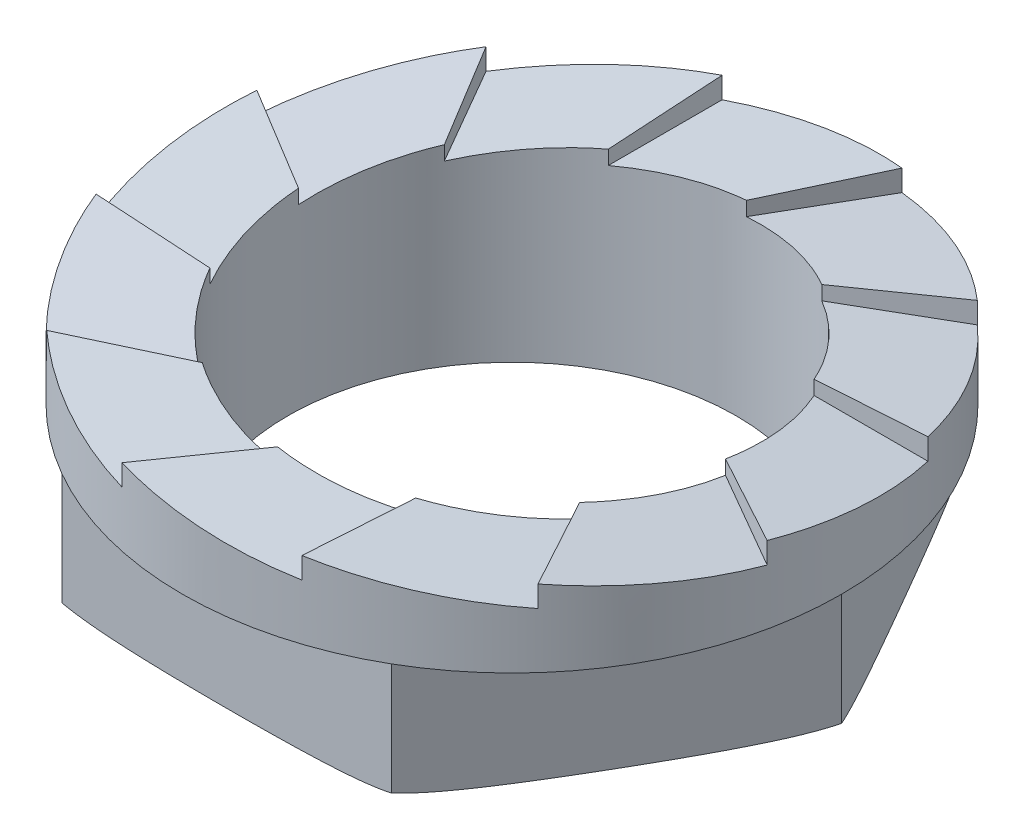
ISO-10303-21;
HEADER;
FILE_DESCRIPTION(('STEP AP214'),'2;1');
FILE_NAME('part.step','',(''),(''),'','','');
FILE_SCHEMA(('AUTOMOTIVE_DESIGN { 1 0 10303 214 1 1 1 1 }'));
ENDSEC;
DATA;
#1=APPLICATION_CONTEXT('core data for automotive mechanical design processes');
#2=APPLICATION_PROTOCOL_DEFINITION('international standard','automotive_design',2000,#1);
#3=PRODUCT_CONTEXT('',#1,'mechanical');
#4=PRODUCT('Part','Part','',(#3));
#5=PRODUCT_RELATED_PRODUCT_CATEGORY('part','',(#4));
#6=PRODUCT_DEFINITION_FORMATION('','',#4);
#7=PRODUCT_DEFINITION_CONTEXT('part definition',#1,'design');
#8=PRODUCT_DEFINITION('design','',#6,#7);
#9=PRODUCT_DEFINITION_SHAPE('','',#8);
#10=(LENGTH_UNIT() NAMED_UNIT(*) SI_UNIT(.MILLI.,.METRE.));
#11=(NAMED_UNIT(*) PLANE_ANGLE_UNIT() SI_UNIT($,.RADIAN.));
#12=(NAMED_UNIT(*) SI_UNIT($,.STERADIAN.) SOLID_ANGLE_UNIT());
#13=UNCERTAINTY_MEASURE_WITH_UNIT(LENGTH_MEASURE(1.E-05),#10,'distance_accuracy_value','');
#14=(GEOMETRIC_REPRESENTATION_CONTEXT(3) GLOBAL_UNCERTAINTY_ASSIGNED_CONTEXT((#13)) GLOBAL_UNIT_ASSIGNED_CONTEXT((#10,
#11,#12)) REPRESENTATION_CONTEXT('',''));
#15=CARTESIAN_POINT('',(0.,0.,0.));
#16=DIRECTION('',(0.,0.,1.));
#17=DIRECTION('',(1.,0.,0.));
#18=AXIS2_PLACEMENT_3D('',#15,#16,#17);
#19=CARTESIAN_POINT('',(0.,0.,0.));
#20=DIRECTION('',(0.,1.,0.));
#21=DIRECTION('',(0.,0.,1.));
#22=AXIS2_PLACEMENT_3D('',#19,#20,#21);
#23=PLANE('',#22);
#24=CARTESIAN_POINT('',(0.,0.,0.));
#25=DIRECTION('',(0.,-1.,0.));
#26=DIRECTION('',(0.,0.,-1.));
#27=AXIS2_PLACEMENT_3D('',#24,#25,#26);
#28=CIRCLE('',#27,5.5);
#29=CARTESIAN_POINT('',(0.,0.,-5.5));
#30=VERTEX_POINT('',#29);
#31=EDGE_CURVE('E407',#30,#30,#28,.T.);
#32=ORIENTED_EDGE('',*,*,#31,.F.);
#33=EDGE_LOOP('',(#32));
#34=FACE_BOUND('',#33,.T.);
#35=CARTESIAN_POINT('',(0.,0.,0.));
#36=DIRECTION('',(0.,1.,0.));
#37=DIRECTION('',(0.,0.,1.));
#38=AXIS2_PLACEMENT_3D('',#35,#36,#37);
#39=CIRCLE('',#38,5.97853936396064);
#40=CARTESIAN_POINT('',(0.,0.,5.97853936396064));
#41=VERTEX_POINT('',#40);
#42=EDGE_CURVE('E273',#41,#41,#39,.T.);
#43=ORIENTED_EDGE('',*,*,#42,.F.);
#44=EDGE_LOOP('',(#43));
#45=FACE_BOUND('',#44,.T.);
#46=ADVANCED_FACE('F41',(#34,#45),#23,.F.);
#47=CARTESIAN_POINT('',(4.04145188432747,3.,6.99999999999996));
#48=DIRECTION('',(-0.866025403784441,0.,-0.499999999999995));
#49=DIRECTION('',(-0.499999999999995,0.,0.866025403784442));
#50=AXIS2_PLACEMENT_3D('',#47,#48,#49);
#51=PLANE('',#50);
#52=DIRECTION('',(0.,-1.,0.));
#53=VECTOR('',#52,1.);
#54=CARTESIAN_POINT('',(4.04145188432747,3.,6.99999999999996));
#55=LINE('',#54,#53);
#56=CARTESIAN_POINT('',(4.04145188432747,3.,6.99999999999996));
#57=VERTEX_POINT('',#56);
#58=CARTESIAN_POINT('',(4.04145188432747,0.255220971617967,6.99999999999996));
#59=VERTEX_POINT('',#58);
#60=EDGE_CURVE('E422',#57,#59,#55,.T.);
#61=ORIENTED_EDGE('',*,*,#60,.T.);
#62=CARTESIAN_POINT('',(4.04145188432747,0.255220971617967,6.99999999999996));
#63=CARTESIAN_POINT('',(4.07075746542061,0.242353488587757,6.9492412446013));
#64=CARTESIAN_POINT('',(4.10019106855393,0.230745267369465,6.89826074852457));
#65=CARTESIAN_POINT('',(4.15923015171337,0.209572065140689,6.79600205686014));
#66=CARTESIAN_POINT('',(4.18883555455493,0.200006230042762,6.74472399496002));
#67=CARTESIAN_POINT('',(4.24806175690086,0.182461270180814,6.6421412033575));
#68=CARTESIAN_POINT('',(4.2776821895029,0.174477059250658,6.5908371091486));
#69=CARTESIAN_POINT('',(4.33700343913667,0.159756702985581,6.48808969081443));
#70=CARTESIAN_POINT('',(4.36670426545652,0.153020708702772,6.43664635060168));
#71=CARTESIAN_POINT('',(4.45582580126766,0.134333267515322,6.28228332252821));
#72=CARTESIAN_POINT('',(4.51532493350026,0.123885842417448,6.17922780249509));
#73=CARTESIAN_POINT('',(4.63441549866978,0.105750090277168,5.97295689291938));
#74=CARTESIAN_POINT('',(4.69400692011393,0.0980614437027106,5.86974152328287));
#75=CARTESIAN_POINT('',(4.81310198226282,0.0846926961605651,5.6634628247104));
#76=CARTESIAN_POINT('',(4.87260549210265,0.0790078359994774,5.56039972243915));
#77=CARTESIAN_POINT('',(4.99167151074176,0.0691074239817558,5.35417132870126));
#78=CARTESIAN_POINT('',(5.0512340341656,0.0648925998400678,5.25100601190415));
#79=CARTESIAN_POINT('',(5.17040000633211,0.0575833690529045,5.04460449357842));
#80=CARTESIAN_POINT('',(5.23000346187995,0.05448941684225,4.94136828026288));
#81=CARTESIAN_POINT('',(5.34923423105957,0.0491793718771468,4.73485453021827));
#82=CARTESIAN_POINT('',(5.40886154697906,0.0469634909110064,4.63157698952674));
#83=CARTESIAN_POINT('',(5.5773990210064,0.0416891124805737,4.33966152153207));
#84=CARTESIAN_POINT('',(5.68631552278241,0.039447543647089,4.15101260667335));
#85=CARTESIAN_POINT('',(5.9041498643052,0.0366997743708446,3.77371245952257));
#86=CARTESIAN_POINT('',(6.01306770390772,0.0361935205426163,3.58506122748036));
#87=CARTESIAN_POINT('',(6.23081669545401,0.0367934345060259,3.20790891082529));
#88=CARTESIAN_POINT('',(6.33964784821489,0.0378983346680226,3.01940782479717));
#89=CARTESIAN_POINT('',(6.55732149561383,0.0419939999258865,2.64238600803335));
#90=CARTESIAN_POINT('',(6.66616398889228,0.0449850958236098,2.4538652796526));
#91=CARTESIAN_POINT('',(6.84788148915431,0.0522187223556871,2.13912133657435));
#92=CARTESIAN_POINT('',(6.92076368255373,0.0557217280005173,2.01288567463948));
#93=CARTESIAN_POINT('',(7.06649386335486,0.0643535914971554,1.76047359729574));
#94=CARTESIAN_POINT('',(7.13934185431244,0.0694821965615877,1.63429717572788));
#95=CARTESIAN_POINT('',(7.28495429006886,0.0820040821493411,1.38208903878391));
#96=CARTESIAN_POINT('',(7.35771875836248,0.089396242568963,1.25605728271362));
#97=CARTESIAN_POINT('',(7.50329974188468,0.10746446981,1.00390362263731));
#98=CARTESIAN_POINT('',(7.57611606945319,0.118147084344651,0.877782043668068));
#99=CARTESIAN_POINT('',(7.6851849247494,0.13795352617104,0.688869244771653));
#100=CARTESIAN_POINT('',(7.72152240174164,0.145187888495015,0.625930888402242));
#101=CARTESIAN_POINT('',(7.79410283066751,0.161272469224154,0.50021789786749));
#102=CARTESIAN_POINT('',(7.8303457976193,0.170122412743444,0.43744323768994));
#103=CARTESIAN_POINT('',(7.90278461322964,0.189937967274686,0.311975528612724));
#104=CARTESIAN_POINT('',(7.93898011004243,0.200908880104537,0.249283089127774));
#105=CARTESIAN_POINT('',(7.99310283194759,0.219482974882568,0.155539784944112));
#106=CARTESIAN_POINT('',(8.01112050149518,0.226029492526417,0.124332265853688));
#107=CARTESIAN_POINT('',(8.04707715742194,0.2399622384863,0.0620535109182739));
#108=CARTESIAN_POINT('',(8.06501613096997,0.247348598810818,0.0309822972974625));
#109=CARTESIAN_POINT('',(8.08290376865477,0.255220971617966,0.));
#110=B_SPLINE_CURVE_WITH_KNOTS('',3,(#62,#63,#64,#65,#66,#67,#68,#69,#70,#71,#72,#73,#74,#75,
#76,#77,#78,#79,#80,#81,#82,#83,#84,#85,#86,#87,#88,#89,#90,#91,#92,#93,#94,#95,#96,#97,#98,#99,
#100,#101,#102,#103,#104,#105,#106,#107,#108,#109),.UNSPECIFIED.,.F.,.F.,(4,2,2,2,2,2,2,2,2,2,2,
2,2,2,2,2,2,2,2,2,2,2,2,4),(0.,0.17997860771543,0.359881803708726,0.539196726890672,
0.718533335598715,1.07684714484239,1.43511943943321,1.79253497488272,2.15012719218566,
2.5078642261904,2.86568749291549,3.5192108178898,4.17271403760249,4.82570336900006,
5.47880725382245,5.91622062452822,6.3535660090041,6.79069532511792,7.22870017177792,
7.44778878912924,7.66684016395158,7.88644635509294,7.99631297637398,8.10619689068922),.UNSPECIFIED.);
#111=CARTESIAN_POINT('',(8.08290376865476,0.255220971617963,0.));
#112=VERTEX_POINT('',#111);
#113=EDGE_CURVE('E65',#59,#112,#110,.T.);
#114=ORIENTED_EDGE('',*,*,#113,.T.);
#115=DIRECTION('',(0.,-1.,0.));
#116=VECTOR('',#115,1.);
#117=CARTESIAN_POINT('',(8.08290376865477,3.,0.));
#118=LINE('',#117,#116);
#119=CARTESIAN_POINT('',(8.08290376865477,3.,0.));
#120=VERTEX_POINT('',#119);
#121=EDGE_CURVE('E437',#120,#112,#118,.T.);
#122=ORIENTED_EDGE('',*,*,#121,.F.);
#123=DIRECTION('',(0.499999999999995,0.,-0.866025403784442));
#124=VECTOR('',#123,1.);
#125=CARTESIAN_POINT('',(4.04145188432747,3.,6.99999999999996));
#126=LINE('',#125,#124);
#127=EDGE_CURVE('E406',#57,#120,#126,.T.);
#128=ORIENTED_EDGE('',*,*,#127,.F.);
#129=EDGE_LOOP('',(#61,#114,#122,#128));
#130=FACE_BOUND('',#129,.T.);
#131=ADVANCED_FACE('F43',(#130),#51,.F.);
#132=CARTESIAN_POINT('',(8.08290376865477,3.,0.));
#133=DIRECTION('',(-0.866025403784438,0.,0.500000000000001));
#134=DIRECTION('',(0.500000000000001,0.,0.866025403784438));
#135=AXIS2_PLACEMENT_3D('',#132,#133,#134);
#136=PLANE('',#135);
#137=ORIENTED_EDGE('',*,*,#121,.T.);
#138=CARTESIAN_POINT('',(8.08290376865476,0.255220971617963,0.));
#139=CARTESIAN_POINT('',(8.05359818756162,0.242353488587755,-0.0507587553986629));
#140=CARTESIAN_POINT('',(8.0241645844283,0.230745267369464,-0.101739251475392));
#141=CARTESIAN_POINT('',(7.96512550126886,0.209572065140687,-0.203997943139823));
#142=CARTESIAN_POINT('',(7.9355200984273,0.200006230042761,-0.255276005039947));
#143=CARTESIAN_POINT('',(7.87629389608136,0.182461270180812,-0.357858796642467));
#144=CARTESIAN_POINT('',(7.84667346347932,0.174477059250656,-0.409162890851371));
#145=CARTESIAN_POINT('',(7.78735221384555,0.159756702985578,-0.511910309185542));
#146=CARTESIAN_POINT('',(7.7576513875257,0.153020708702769,-0.563353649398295));
#147=CARTESIAN_POINT('',(7.66852985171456,0.134333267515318,-0.717716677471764));
#148=CARTESIAN_POINT('',(7.60903071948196,0.123885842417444,-0.820772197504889));
#149=CARTESIAN_POINT('',(7.48994015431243,0.105750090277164,-1.0270431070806));
#150=CARTESIAN_POINT('',(7.43034873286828,0.0980614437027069,-1.13025847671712));
#151=CARTESIAN_POINT('',(7.31125367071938,0.0846926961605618,-1.33653717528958));
#152=CARTESIAN_POINT('',(7.25175016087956,0.0790078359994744,-1.43960027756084));
#153=CARTESIAN_POINT('',(7.13268414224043,0.0691074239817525,-1.64582867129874));
#154=CARTESIAN_POINT('',(7.07312161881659,0.0648925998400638,-1.74899398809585));
#155=CARTESIAN_POINT('',(6.95395564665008,0.0575833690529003,-1.95539550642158));
#156=CARTESIAN_POINT('',(6.89435219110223,0.0544894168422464,-2.05863171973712));
#157=CARTESIAN_POINT('',(6.77512142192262,0.0491793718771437,-2.26514546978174));
#158=CARTESIAN_POINT('',(6.71549410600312,0.0469634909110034,-2.36842301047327));
#159=CARTESIAN_POINT('',(6.54695663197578,0.041689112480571,-2.66033847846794));
#160=CARTESIAN_POINT('',(6.43804013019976,0.0394475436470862,-2.84898739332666));
#161=CARTESIAN_POINT('',(6.22020578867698,0.0366997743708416,-3.22628754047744));
#162=CARTESIAN_POINT('',(6.11128794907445,0.036193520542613,-3.41493877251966));
#163=CARTESIAN_POINT('',(5.89353895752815,0.0367934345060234,-3.79209108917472));
#164=CARTESIAN_POINT('',(5.78470780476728,0.0378983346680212,-3.98059217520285));
#165=CARTESIAN_POINT('',(5.56703415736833,0.0419939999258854,-4.35761399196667));
#166=CARTESIAN_POINT('',(5.45819166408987,0.0449850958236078,-4.54613472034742));
#167=CARTESIAN_POINT('',(5.27647416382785,0.0522187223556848,-4.86087866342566));
#168=CARTESIAN_POINT('',(5.20359197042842,0.0557217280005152,-4.98711432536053));
#169=CARTESIAN_POINT('',(5.05786178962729,0.0643535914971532,-5.23952640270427));
#170=CARTESIAN_POINT('',(4.98501379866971,0.0694821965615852,-5.36570282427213));
#171=CARTESIAN_POINT('',(4.83940136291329,0.0820040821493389,-5.61791096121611));
#172=CARTESIAN_POINT('',(4.76663689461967,0.0893962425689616,-5.7439427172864));
#173=CARTESIAN_POINT('',(4.62105591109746,0.107464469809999,-5.9960963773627));
#174=CARTESIAN_POINT('',(4.54823958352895,0.11814708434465,-6.12221795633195));
#175=CARTESIAN_POINT('',(4.43917072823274,0.137953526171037,-6.31113075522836));
#176=CARTESIAN_POINT('',(4.4028332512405,0.145187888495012,-6.37406911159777));
#177=CARTESIAN_POINT('',(4.33025282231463,0.161272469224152,-6.49978210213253));
#178=CARTESIAN_POINT('',(4.29400985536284,0.170122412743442,-6.56255676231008));
#179=CARTESIAN_POINT('',(4.2215710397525,0.189937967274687,-6.68802447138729));
#180=CARTESIAN_POINT('',(4.18537554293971,0.200908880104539,-6.75071691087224));
#181=CARTESIAN_POINT('',(4.13125282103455,0.219482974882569,-6.8444602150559));
#182=CARTESIAN_POINT('',(4.11323515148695,0.226029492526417,-6.87566773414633));
#183=CARTESIAN_POINT('',(4.07727849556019,0.239962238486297,-6.93794648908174));
#184=CARTESIAN_POINT('',(4.05933952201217,0.247348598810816,-6.96901770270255));
#185=CARTESIAN_POINT('',(4.04145188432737,0.255220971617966,-7.00000000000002));
#186=B_SPLINE_CURVE_WITH_KNOTS('',3,(#138,#139,#140,#141,#142,#143,#144,#145,#146,#147,#148,
#149,#150,#151,#152,#153,#154,#155,#156,#157,#158,#159,#160,#161,#162,#163,#164,#165,#166,#167,
#168,#169,#170,#171,#172,#173,#174,#175,#176,#177,#178,#179,#180,#181,#182,#183,#184,#185),
.UNSPECIFIED.,.F.,.F.,(4,2,2,2,2,2,2,2,2,2,2,2,2,2,2,2,2,2,2,2,2,2,2,4),(0.,0.179978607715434,
0.359881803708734,0.539196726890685,0.718533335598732,1.07684714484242,1.43511943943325,
1.79253497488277,2.15012719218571,2.50786422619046,2.86568749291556,3.51921081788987,
4.17271403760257,4.82570336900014,5.47880725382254,5.91622062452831,6.35356600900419,
6.79069532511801,7.22870017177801,7.44778878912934,7.66684016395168,7.88644635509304,
7.99631297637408,8.10619689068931),.UNSPECIFIED.);
#187=CARTESIAN_POINT('',(4.04145188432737,0.255220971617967,-7.00000000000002));
#188=VERTEX_POINT('',#187);
#189=EDGE_CURVE('E328',#112,#188,#186,.T.);
#190=ORIENTED_EDGE('',*,*,#189,.T.);
#191=DIRECTION('',(0.,-1.,0.));
#192=VECTOR('',#191,1.);
#193=CARTESIAN_POINT('',(4.04145188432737,3.,-7.00000000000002));
#194=LINE('',#193,#192);
#195=CARTESIAN_POINT('',(4.04145188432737,3.,-7.00000000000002));
#196=VERTEX_POINT('',#195);
#197=EDGE_CURVE('E434',#196,#188,#194,.T.);
#198=ORIENTED_EDGE('',*,*,#197,.F.);
#199=DIRECTION('',(-0.500000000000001,0.,-0.866025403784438));
#200=VECTOR('',#199,1.);
#201=CARTESIAN_POINT('',(8.08290376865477,3.,0.));
#202=LINE('',#201,#200);
#203=EDGE_CURVE('E410',#120,#196,#202,.T.);
#204=ORIENTED_EDGE('',*,*,#203,.F.);
#205=EDGE_LOOP('',(#137,#190,#198,#204));
#206=FACE_BOUND('',#205,.T.);
#207=ADVANCED_FACE('F339',(#206),#136,.F.);
#208=CARTESIAN_POINT('',(4.04145188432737,3.,-7.00000000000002));
#209=DIRECTION('',(0.,0.,1.));
#210=DIRECTION('',(1.,0.,0.));
#211=AXIS2_PLACEMENT_3D('',#208,#209,#210);
#212=PLANE('',#211);
#213=ORIENTED_EDGE('',*,*,#197,.T.);
#214=CARTESIAN_POINT('',(4.04145188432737,0.255220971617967,-7.00000000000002));
#215=CARTESIAN_POINT('',(3.98284072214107,0.242353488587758,-7.00000000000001));
#216=CARTESIAN_POINT('',(3.92397351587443,0.230745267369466,-7.00000000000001));
#217=CARTESIAN_POINT('',(3.80589534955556,0.209572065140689,-7.00000000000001));
#218=CARTESIAN_POINT('',(3.74668454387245,0.200006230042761,-7.00000000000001));
#219=CARTESIAN_POINT('',(3.62823213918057,0.182461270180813,-7.00000000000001));
#220=CARTESIAN_POINT('',(3.56899127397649,0.174477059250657,-7.00000000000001));
#221=CARTESIAN_POINT('',(3.45034877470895,0.159756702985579,-7.00000000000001));
#222=CARTESIAN_POINT('',(3.39094712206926,0.15302070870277,-7.00000000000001));
#223=CARTESIAN_POINT('',(3.21270405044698,0.134333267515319,-7.00000000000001));
#224=CARTESIAN_POINT('',(3.09370578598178,0.123885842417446,-7.00000000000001));
#225=CARTESIAN_POINT('',(2.85552465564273,0.105750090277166,-7.00000000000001));
#226=CARTESIAN_POINT('',(2.73634181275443,0.0980614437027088,-7.00000000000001));
#227=CARTESIAN_POINT('',(2.49815168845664,0.0846926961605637,-7.00000000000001));
#228=CARTESIAN_POINT('',(2.37914466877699,0.0790078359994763,-7.00000000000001));
#229=CARTESIAN_POINT('',(2.14101263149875,0.0691074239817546,-7.00000000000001));
#230=CARTESIAN_POINT('',(2.02188758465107,0.0648925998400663,-7.00000000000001));
#231=CARTESIAN_POINT('',(1.78355564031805,0.057583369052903,-7.00000000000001));
#232=CARTESIAN_POINT('',(1.66434872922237,0.0544894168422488,-7.00000000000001));
#233=CARTESIAN_POINT('',(1.42588719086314,0.0491793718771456,-7.00000000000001));
#234=CARTESIAN_POINT('',(1.30663255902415,0.0469634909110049,-7.));
#235=CARTESIAN_POINT('',(0.969557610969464,0.0416891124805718,-7.));
#236=CARTESIAN_POINT('',(0.751724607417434,0.0394475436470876,-7.));
#237=CARTESIAN_POINT('',(0.316055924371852,0.0366997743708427,-7.));
#238=CARTESIAN_POINT('',(0.0982202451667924,0.0361935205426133,-7.));
#239=CARTESIAN_POINT('',(-0.337277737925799,0.0367934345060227,-7.));
#240=CARTESIAN_POINT('',(-0.554940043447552,0.0378983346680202,-7.));
#241=CARTESIAN_POINT('',(-0.990287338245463,0.0419939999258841,-7.));
#242=CARTESIAN_POINT('',(-1.20797232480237,0.0449850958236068,-7.));
#243=CARTESIAN_POINT('',(-1.57140732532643,0.0522187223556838,-7.));
#244=CARTESIAN_POINT('',(-1.71717171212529,0.055721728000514,-6.99999999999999));
#245=CARTESIAN_POINT('',(-2.00863207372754,0.0643535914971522,-6.99999999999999));
#246=CARTESIAN_POINT('',(-2.15432805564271,0.0694821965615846,-6.99999999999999));
#247=CARTESIAN_POINT('',(-2.44555292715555,0.0820040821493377,-6.99999999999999));
#248=CARTESIAN_POINT('',(-2.5910818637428,0.0893962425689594,-6.99999999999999));
#249=CARTESIAN_POINT('',(-2.88224383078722,0.107464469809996,-6.99999999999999));
#250=CARTESIAN_POINT('',(-3.02787648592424,0.118147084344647,-6.99999999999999));
#251=CARTESIAN_POINT('',(-3.24601419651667,0.137953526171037,-6.99999999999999));
#252=CARTESIAN_POINT('',(-3.31868915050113,0.145187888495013,-6.99999999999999));
#253=CARTESIAN_POINT('',(-3.46385000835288,0.161272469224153,-6.99999999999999));
#254=CARTESIAN_POINT('',(-3.53633594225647,0.170122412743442,-6.99999999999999));
#255=CARTESIAN_POINT('',(-3.68121357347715,0.189937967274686,-6.99999999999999));
#256=CARTESIAN_POINT('',(-3.75360456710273,0.200908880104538,-6.99999999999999));
#257=CARTESIAN_POINT('',(-3.86185001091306,0.219482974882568,-6.99999999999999));
#258=CARTESIAN_POINT('',(-3.89788535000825,0.226029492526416,-6.99999999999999));
#259=CARTESIAN_POINT('',(-3.96979866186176,0.239962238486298,-6.99999999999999));
#260=CARTESIAN_POINT('',(-4.00567660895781,0.247348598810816,-6.99999999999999));
#261=CARTESIAN_POINT('',(-4.04145188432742,0.255220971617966,-6.99999999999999));
#262=B_SPLINE_CURVE_WITH_KNOTS('',3,(#214,#215,#216,#217,#218,#219,#220,#221,#222,#223,#224,
#225,#226,#227,#228,#229,#230,#231,#232,#233,#234,#235,#236,#237,#238,#239,#240,#241,#242,#243,
#244,#245,#246,#247,#248,#249,#250,#251,#252,#253,#254,#255,#256,#257,#258,#259,#260,#261),
.UNSPECIFIED.,.F.,.F.,(4,2,2,2,2,2,2,2,2,2,2,2,2,2,2,2,2,2,2,2,2,2,2,4),(0.,0.17997860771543,
0.359881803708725,0.539196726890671,0.718533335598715,1.07684714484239,1.43511943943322,
1.79253497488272,2.15012719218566,2.5078642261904,2.86568749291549,3.51921081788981,
4.17271403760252,4.8257033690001,5.4788072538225,5.91622062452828,6.35356600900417,
6.790695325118,7.22870017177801,7.44778878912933,7.66684016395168,7.88644635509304,
7.99631297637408,8.10619689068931),.UNSPECIFIED.);
#263=CARTESIAN_POINT('',(-4.04145188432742,0.255220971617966,-6.99999999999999));
#264=VERTEX_POINT('',#263);
#265=EDGE_CURVE('E321',#188,#264,#262,.T.);
#266=ORIENTED_EDGE('',*,*,#265,.T.);
#267=DIRECTION('',(0.,-1.,0.));
#268=VECTOR('',#267,1.);
#269=CARTESIAN_POINT('',(-4.04145188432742,3.,-6.99999999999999));
#270=LINE('',#269,#268);
#271=CARTESIAN_POINT('',(-4.04145188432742,3.,-6.99999999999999));
#272=VERTEX_POINT('',#271);
#273=EDGE_CURVE('E431',#272,#264,#270,.T.);
#274=ORIENTED_EDGE('',*,*,#273,.F.);
#275=DIRECTION('',(-1.,0.,0.));
#276=VECTOR('',#275,1.);
#277=CARTESIAN_POINT('',(4.04145188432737,3.,-7.00000000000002));
#278=LINE('',#277,#276);
#279=EDGE_CURVE('E413',#196,#272,#278,.T.);
#280=ORIENTED_EDGE('',*,*,#279,.F.);
#281=EDGE_LOOP('',(#213,#266,#274,#280));
#282=FACE_BOUND('',#281,.T.);
#283=ADVANCED_FACE('F342',(#282),#212,.F.);
#284=CARTESIAN_POINT('',(-4.04145188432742,3.,-6.99999999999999));
#285=DIRECTION('',(0.866025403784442,0.,0.499999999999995));
#286=DIRECTION('',(0.499999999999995,0.,-0.866025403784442));
#287=AXIS2_PLACEMENT_3D('',#284,#285,#286);
#288=PLANE('',#287);
#289=ORIENTED_EDGE('',*,*,#273,.T.);
#290=CARTESIAN_POINT('',(-4.04145188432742,0.255220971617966,-6.99999999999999));
#291=CARTESIAN_POINT('',(-4.07075746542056,0.242353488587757,-6.94924124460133));
#292=CARTESIAN_POINT('',(-4.10019106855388,0.230745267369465,-6.8982607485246));
#293=CARTESIAN_POINT('',(-4.15923015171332,0.209572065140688,-6.79600205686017));
#294=CARTESIAN_POINT('',(-4.18883555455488,0.200006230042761,-6.74472399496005));
#295=CARTESIAN_POINT('',(-4.24806175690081,0.182461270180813,-6.64214120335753));
#296=CARTESIAN_POINT('',(-4.27768218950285,0.174477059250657,-6.59083710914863));
#297=CARTESIAN_POINT('',(-4.33700343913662,0.159756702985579,-6.48808969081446));
#298=CARTESIAN_POINT('',(-4.36670426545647,0.153020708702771,-6.4366463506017));
#299=CARTESIAN_POINT('',(-4.45582580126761,0.13433326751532,-6.28228332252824));
#300=CARTESIAN_POINT('',(-4.51532493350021,0.123885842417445,-6.17922780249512));
#301=CARTESIAN_POINT('',(-4.63441549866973,0.105750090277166,-5.97295689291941));
#302=CARTESIAN_POINT('',(-4.69400692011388,0.0980614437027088,-5.86974152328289));
#303=CARTESIAN_POINT('',(-4.81310198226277,0.0846926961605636,-5.66346282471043));
#304=CARTESIAN_POINT('',(-4.8726054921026,0.0790078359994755,-5.56039972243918));
#305=CARTESIAN_POINT('',(-4.99167151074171,0.0691074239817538,-5.35417132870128));
#306=CARTESIAN_POINT('',(-5.05123403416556,0.0648925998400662,-5.25100601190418));
#307=CARTESIAN_POINT('',(-5.17040000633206,0.0575833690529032,-5.04460449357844));
#308=CARTESIAN_POINT('',(-5.23000346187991,0.0544894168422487,-4.94136828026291));
#309=CARTESIAN_POINT('',(-5.34923423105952,0.0491793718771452,-4.73485453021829));
#310=CARTESIAN_POINT('',(-5.40886154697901,0.0469634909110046,-4.63157698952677));
#311=CARTESIAN_POINT('',(-5.57739902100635,0.0416891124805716,-4.33966152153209));
#312=CARTESIAN_POINT('',(-5.68631552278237,0.039447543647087,-4.15101260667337));
#313=CARTESIAN_POINT('',(-5.90414986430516,0.0366997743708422,-3.77371245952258));
#314=CARTESIAN_POINT('',(-6.01306770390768,0.0361935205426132,-3.58506122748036));
#315=CARTESIAN_POINT('',(-6.23081669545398,0.0367934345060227,-3.20790891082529));
#316=CARTESIAN_POINT('',(-6.33964784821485,0.03789833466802,-3.01940782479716));
#317=CARTESIAN_POINT('',(-6.55732149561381,0.041993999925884,-2.64238600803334));
#318=CARTESIAN_POINT('',(-6.66616398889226,0.0449850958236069,-2.45386527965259));
#319=CARTESIAN_POINT('',(-6.84788148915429,0.0522187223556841,-2.13912133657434));
#320=CARTESIAN_POINT('',(-6.92076368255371,0.0557217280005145,-2.01288567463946));
#321=CARTESIAN_POINT('',(-7.06649386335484,0.0643535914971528,-1.76047359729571));
#322=CARTESIAN_POINT('',(-7.13934185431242,0.0694821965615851,-1.63429717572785));
#323=CARTESIAN_POINT('',(-7.28495429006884,0.0820040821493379,-1.38208903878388));
#324=CARTESIAN_POINT('',(-7.35771875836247,0.0893962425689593,-1.25605728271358));
#325=CARTESIAN_POINT('',(-7.50329974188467,0.107464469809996,-1.00390362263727));
#326=CARTESIAN_POINT('',(-7.57611606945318,0.118147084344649,-0.877782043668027));
#327=CARTESIAN_POINT('',(-7.6851849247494,0.137953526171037,-0.688869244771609));
#328=CARTESIAN_POINT('',(-7.72152240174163,0.145187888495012,-0.625930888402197));
#329=CARTESIAN_POINT('',(-7.7941028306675,0.161272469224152,-0.500217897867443));
#330=CARTESIAN_POINT('',(-7.8303457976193,0.170122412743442,-0.437443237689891));
#331=CARTESIAN_POINT('',(-7.90278461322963,0.189937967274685,-0.311975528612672));
#332=CARTESIAN_POINT('',(-7.93898011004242,0.200908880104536,-0.249283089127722));
#333=CARTESIAN_POINT('',(-7.99310283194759,0.219482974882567,-0.155539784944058));
#334=CARTESIAN_POINT('',(-8.01112050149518,0.226029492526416,-0.124332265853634));
#335=CARTESIAN_POINT('',(-8.04707715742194,0.239962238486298,-0.0620535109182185));
#336=CARTESIAN_POINT('',(-8.06501613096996,0.247348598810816,-0.0309822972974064));
#337=CARTESIAN_POINT('',(-8.08290376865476,0.255220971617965,0.));
#338=B_SPLINE_CURVE_WITH_KNOTS('',3,(#290,#291,#292,#293,#294,#295,#296,#297,#298,#299,#300,
#301,#302,#303,#304,#305,#306,#307,#308,#309,#310,#311,#312,#313,#314,#315,#316,#317,#318,#319,
#320,#321,#322,#323,#324,#325,#326,#327,#328,#329,#330,#331,#332,#333,#334,#335,#336,#337),
.UNSPECIFIED.,.F.,.F.,(4,2,2,2,2,2,2,2,2,2,2,2,2,2,2,2,2,2,2,2,2,2,2,4),(0.,0.17997860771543,
0.359881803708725,0.539196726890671,0.718533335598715,1.07684714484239,1.43511943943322,
1.79253497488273,2.15012719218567,2.5078642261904,2.8656874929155,3.51921081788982,
4.17271403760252,4.8257033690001,5.4788072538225,5.91622062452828,6.35356600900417,
6.79069532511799,7.228700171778,7.44778878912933,7.66684016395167,7.88644635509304,
7.99631297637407,8.10619689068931),.UNSPECIFIED.);
#339=CARTESIAN_POINT('',(-8.08290376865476,0.255220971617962,0.));
#340=VERTEX_POINT('',#339);
#341=EDGE_CURVE('E314',#264,#340,#338,.T.);
#342=ORIENTED_EDGE('',*,*,#341,.T.);
#343=DIRECTION('',(0.,-1.,0.));
#344=VECTOR('',#343,1.);
#345=CARTESIAN_POINT('',(-8.08290376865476,3.,0.));
#346=LINE('',#345,#344);
#347=CARTESIAN_POINT('',(-8.08290376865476,3.,0.));
#348=VERTEX_POINT('',#347);
#349=EDGE_CURVE('E428',#348,#340,#346,.T.);
#350=ORIENTED_EDGE('',*,*,#349,.F.);
#351=DIRECTION('',(-0.499999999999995,0.,0.866025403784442));
#352=VECTOR('',#351,1.);
#353=CARTESIAN_POINT('',(-4.04145188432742,3.,-6.99999999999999));
#354=LINE('',#353,#352);
#355=EDGE_CURVE('E416',#272,#348,#354,.T.);
#356=ORIENTED_EDGE('',*,*,#355,.F.);
#357=EDGE_LOOP('',(#289,#342,#350,#356));
#358=FACE_BOUND('',#357,.T.);
#359=ADVANCED_FACE('F346',(#358),#288,.F.);
#360=CARTESIAN_POINT('',(-8.08290376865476,3.,0.));
#361=DIRECTION('',(0.866025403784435,0.,-0.500000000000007));
#362=DIRECTION('',(-0.500000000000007,0.,-0.866025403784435));
#363=AXIS2_PLACEMENT_3D('',#360,#361,#362);
#364=PLANE('',#363);
#365=ORIENTED_EDGE('',*,*,#349,.T.);
#366=CARTESIAN_POINT('',(-8.08290376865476,0.255220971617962,0.));
#367=CARTESIAN_POINT('',(-8.05359818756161,0.242353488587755,0.0507587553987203));
#368=CARTESIAN_POINT('',(-8.02416458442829,0.230745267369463,0.101739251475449));
#369=CARTESIAN_POINT('',(-7.96512550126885,0.209572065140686,0.203997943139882));
#370=CARTESIAN_POINT('',(-7.93552009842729,0.200006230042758,0.255276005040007));
#371=CARTESIAN_POINT('',(-7.87629389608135,0.182461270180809,0.357858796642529));
#372=CARTESIAN_POINT('',(-7.84667346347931,0.174477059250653,0.409162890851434));
#373=CARTESIAN_POINT('',(-7.78735221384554,0.159756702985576,0.511910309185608));
#374=CARTESIAN_POINT('',(-7.75765138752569,0.153020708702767,0.563353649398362));
#375=CARTESIAN_POINT('',(-7.66852985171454,0.134333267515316,0.717716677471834));
#376=CARTESIAN_POINT('',(-7.60903071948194,0.123885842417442,0.82077219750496));
#377=CARTESIAN_POINT('',(-7.48994015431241,0.105750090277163,1.02704310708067));
#378=CARTESIAN_POINT('',(-7.43034873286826,0.0980614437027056,1.13025847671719));
#379=CARTESIAN_POINT('',(-7.31125367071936,0.0846926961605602,1.33653717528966));
#380=CARTESIAN_POINT('',(-7.25175016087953,0.0790078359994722,1.43960027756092));
#381=CARTESIAN_POINT('',(-7.1326841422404,0.0691074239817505,1.64582867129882));
#382=CARTESIAN_POINT('',(-7.07312161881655,0.0648925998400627,1.74899398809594));
#383=CARTESIAN_POINT('',(-6.95395564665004,0.0575833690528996,1.95539550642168));
#384=CARTESIAN_POINT('',(-6.89435219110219,0.054489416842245,2.05863171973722));
#385=CARTESIAN_POINT('',(-6.77512142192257,0.0491793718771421,2.26514546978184));
#386=CARTESIAN_POINT('',(-6.71549410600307,0.0469634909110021,2.36842301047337));
#387=CARTESIAN_POINT('',(-6.54695663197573,0.0416891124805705,2.66033847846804));
#388=CARTESIAN_POINT('',(-6.43804013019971,0.0394475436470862,2.84898739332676));
#389=CARTESIAN_POINT('',(-6.22020578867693,0.0366997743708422,3.22628754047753));
#390=CARTESIAN_POINT('',(-6.1112879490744,0.0361935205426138,3.41493877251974));
#391=CARTESIAN_POINT('',(-5.8935389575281,0.0367934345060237,3.7920910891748));
#392=CARTESIAN_POINT('',(-5.78470780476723,0.0378983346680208,3.98059217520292));
#393=CARTESIAN_POINT('',(-5.56703415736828,0.0419939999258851,4.35761399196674));
#394=CARTESIAN_POINT('',(-5.45819166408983,0.0449850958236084,4.54613472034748));
#395=CARTESIAN_POINT('',(-5.2764741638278,0.0522187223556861,4.86087866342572));
#396=CARTESIAN_POINT('',(-5.20359197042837,0.0557217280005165,4.98711432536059));
#397=CARTESIAN_POINT('',(-5.05786178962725,0.0643535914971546,5.23952640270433));
#398=CARTESIAN_POINT('',(-4.98501379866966,0.0694821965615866,5.36570282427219));
#399=CARTESIAN_POINT('',(-4.83940136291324,0.0820040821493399,5.61791096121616));
#400=CARTESIAN_POINT('',(-4.76663689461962,0.0893962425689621,5.74394271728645));
#401=CARTESIAN_POINT('',(-4.62105591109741,0.107464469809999,5.99609637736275));
#402=CARTESIAN_POINT('',(-4.5482395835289,0.11814708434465,6.12221795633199));
#403=CARTESIAN_POINT('',(-4.43917072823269,0.137953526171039,6.3111307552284));
#404=CARTESIAN_POINT('',(-4.40283325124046,0.145187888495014,6.37406911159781));
#405=CARTESIAN_POINT('',(-4.33025282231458,0.161272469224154,6.49978210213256));
#406=CARTESIAN_POINT('',(-4.29400985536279,0.170122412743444,6.56255676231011));
#407=CARTESIAN_POINT('',(-4.22157103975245,0.189937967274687,6.68802447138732));
#408=CARTESIAN_POINT('',(-4.18537554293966,0.200908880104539,6.75071691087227));
#409=CARTESIAN_POINT('',(-4.1312528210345,0.219482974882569,6.84446021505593));
#410=CARTESIAN_POINT('',(-4.1132351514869,0.226029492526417,6.87566773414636));
#411=CARTESIAN_POINT('',(-4.07727849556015,0.239962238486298,6.93794648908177));
#412=CARTESIAN_POINT('',(-4.05933952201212,0.247348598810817,6.96901770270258));
#413=CARTESIAN_POINT('',(-4.04145188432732,0.255220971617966,7.00000000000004));
#414=B_SPLINE_CURVE_WITH_KNOTS('',3,(#366,#367,#368,#369,#370,#371,#372,#373,#374,#375,#376,
#377,#378,#379,#380,#381,#382,#383,#384,#385,#386,#387,#388,#389,#390,#391,#392,#393,#394,#395,
#396,#397,#398,#399,#400,#401,#402,#403,#404,#405,#406,#407,#408,#409,#410,#411,#412,#413),
.UNSPECIFIED.,.F.,.F.,(4,2,2,2,2,2,2,2,2,2,2,2,2,2,2,2,2,2,2,2,2,2,2,4),(0.,0.179978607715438,
0.359881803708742,0.539196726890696,0.718533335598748,1.07684714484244,1.43511943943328,
1.79253497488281,2.15012719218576,2.50786422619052,2.86568749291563,3.51921081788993,
4.17271403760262,4.82570336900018,5.47880725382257,5.91622062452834,6.35356600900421,
6.79069532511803,7.22870017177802,7.44778878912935,7.66684016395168,7.88644635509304,
7.99631297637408,8.10619689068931),.UNSPECIFIED.);
#415=CARTESIAN_POINT('',(-4.04145188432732,0.255220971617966,7.00000000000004));
#416=VERTEX_POINT('',#415);
#417=EDGE_CURVE('E306',#340,#416,#414,.T.);
#418=ORIENTED_EDGE('',*,*,#417,.T.);
#419=DIRECTION('',(0.,-1.,0.));
#420=VECTOR('',#419,1.);
#421=CARTESIAN_POINT('',(-4.04145188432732,3.,7.00000000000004));
#422=LINE('',#421,#420);
#423=CARTESIAN_POINT('',(-4.04145188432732,3.,7.00000000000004));
#424=VERTEX_POINT('',#423);
#425=EDGE_CURVE('E425',#424,#416,#422,.T.);
#426=ORIENTED_EDGE('',*,*,#425,.F.);
#427=DIRECTION('',(0.500000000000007,0.,0.866025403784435));
#428=VECTOR('',#427,1.);
#429=CARTESIAN_POINT('',(-8.08290376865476,3.,0.));
#430=LINE('',#429,#428);
#431=EDGE_CURVE('E391',#348,#424,#430,.T.);
#432=ORIENTED_EDGE('',*,*,#431,.F.);
#433=EDGE_LOOP('',(#365,#418,#426,#432));
#434=FACE_BOUND('',#433,.T.);
#435=ADVANCED_FACE('F350',(#434),#364,.F.);
#436=CARTESIAN_POINT('',(-4.04145188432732,3.,7.00000000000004));
#437=DIRECTION('',(0.,0.,-1.));
#438=DIRECTION('',(-1.,0.,0.));
#439=AXIS2_PLACEMENT_3D('',#436,#437,#438);
#440=PLANE('',#439);
#441=ORIENTED_EDGE('',*,*,#425,.T.);
#442=CARTESIAN_POINT('',(-4.04145188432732,0.255220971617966,7.00000000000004));
#443=CARTESIAN_POINT('',(-3.98284072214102,0.242353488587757,7.00000000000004));
#444=CARTESIAN_POINT('',(-3.92397351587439,0.230745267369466,7.00000000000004));
#445=CARTESIAN_POINT('',(-3.80589534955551,0.209572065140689,7.00000000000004));
#446=CARTESIAN_POINT('',(-3.7466845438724,0.200006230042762,7.00000000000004));
#447=CARTESIAN_POINT('',(-3.62823213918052,0.182461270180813,7.00000000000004));
#448=CARTESIAN_POINT('',(-3.56899127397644,0.174477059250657,7.00000000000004));
#449=CARTESIAN_POINT('',(-3.4503487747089,0.159756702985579,7.00000000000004));
#450=CARTESIAN_POINT('',(-3.39094712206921,0.153020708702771,7.00000000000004));
#451=CARTESIAN_POINT('',(-3.21270405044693,0.13433326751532,7.00000000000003));
#452=CARTESIAN_POINT('',(-3.09370578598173,0.123885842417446,7.00000000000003));
#453=CARTESIAN_POINT('',(-2.85552465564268,0.105750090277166,7.00000000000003));
#454=CARTESIAN_POINT('',(-2.73634181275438,0.0980614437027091,7.00000000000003));
#455=CARTESIAN_POINT('',(-2.49815168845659,0.0846926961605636,7.00000000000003));
#456=CARTESIAN_POINT('',(-2.37914466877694,0.0790078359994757,7.00000000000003));
#457=CARTESIAN_POINT('',(-2.1410126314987,0.0691074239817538,7.00000000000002));
#458=CARTESIAN_POINT('',(-2.02188758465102,0.0648925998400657,7.00000000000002));
#459=CARTESIAN_POINT('',(-1.783555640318,0.0575833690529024,7.00000000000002));
#460=CARTESIAN_POINT('',(-1.66434872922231,0.0544894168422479,7.00000000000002));
#461=CARTESIAN_POINT('',(-1.42588719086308,0.0491793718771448,7.00000000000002));
#462=CARTESIAN_POINT('',(-1.30663255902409,0.0469634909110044,7.00000000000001));
#463=CARTESIAN_POINT('',(-0.969557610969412,0.0416891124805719,7.00000000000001));
#464=CARTESIAN_POINT('',(-0.751724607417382,0.0394475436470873,7.00000000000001));
#465=CARTESIAN_POINT('',(-0.3160559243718,0.0366997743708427,7.));
#466=CARTESIAN_POINT('',(-0.0982202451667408,0.0361935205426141,7.));
#467=CARTESIAN_POINT('',(0.33727773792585,0.0367934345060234,7.));
#468=CARTESIAN_POINT('',(0.554940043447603,0.0378983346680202,6.99999999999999));
#469=CARTESIAN_POINT('',(0.990287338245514,0.0419939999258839,6.99999999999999));
#470=CARTESIAN_POINT('',(1.20797232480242,0.0449850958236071,6.99999999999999));
#471=CARTESIAN_POINT('',(1.57140732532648,0.0522187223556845,6.99999999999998));
#472=CARTESIAN_POINT('',(1.71717171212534,0.0557217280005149,6.99999999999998));
#473=CARTESIAN_POINT('',(2.00863207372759,0.0643535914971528,6.99999999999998));
#474=CARTESIAN_POINT('',(2.15432805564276,0.0694821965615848,6.99999999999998));
#475=CARTESIAN_POINT('',(2.4455529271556,0.0820040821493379,6.99999999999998));
#476=CARTESIAN_POINT('',(2.59108186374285,0.0893962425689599,6.99999999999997));
#477=CARTESIAN_POINT('',(2.88224383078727,0.107464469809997,6.99999999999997));
#478=CARTESIAN_POINT('',(3.02787648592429,0.118147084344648,6.99999999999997));
#479=CARTESIAN_POINT('',(3.24601419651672,0.137953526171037,6.99999999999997));
#480=CARTESIAN_POINT('',(3.31868915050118,0.145187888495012,6.99999999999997));
#481=CARTESIAN_POINT('',(3.46385000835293,0.161272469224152,6.99999999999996));
#482=CARTESIAN_POINT('',(3.53633594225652,0.170122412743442,6.99999999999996));
#483=CARTESIAN_POINT('',(3.6812135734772,0.189937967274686,6.99999999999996));
#484=CARTESIAN_POINT('',(3.75360456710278,0.200908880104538,6.99999999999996));
#485=CARTESIAN_POINT('',(3.86185001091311,0.219482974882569,6.99999999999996));
#486=CARTESIAN_POINT('',(3.8978853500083,0.226029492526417,6.99999999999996));
#487=CARTESIAN_POINT('',(3.96979866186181,0.239962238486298,6.99999999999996));
#488=CARTESIAN_POINT('',(4.00567660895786,0.247348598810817,6.99999999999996));
#489=CARTESIAN_POINT('',(4.04145188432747,0.255220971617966,6.99999999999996));
#490=B_SPLINE_CURVE_WITH_KNOTS('',3,(#442,#443,#444,#445,#446,#447,#448,#449,#450,#451,#452,
#453,#454,#455,#456,#457,#458,#459,#460,#461,#462,#463,#464,#465,#466,#467,#468,#469,#470,#471,
#472,#473,#474,#475,#476,#477,#478,#479,#480,#481,#482,#483,#484,#485,#486,#487,#488,#489),
.UNSPECIFIED.,.F.,.F.,(4,2,2,2,2,2,2,2,2,2,2,2,2,2,2,2,2,2,2,2,2,2,2,4),(0.,0.179978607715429,
0.359881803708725,0.539196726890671,0.718533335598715,1.07684714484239,1.43511943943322,
1.79253497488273,2.15012719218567,2.5078642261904,2.8656874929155,3.51921081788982,
4.17271403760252,4.8257033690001,5.4788072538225,5.91622062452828,6.35356600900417,
6.790695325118,7.22870017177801,7.44778878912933,7.66684016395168,7.88644635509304,
7.99631297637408,8.10619689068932),.UNSPECIFIED.);
#491=EDGE_CURVE('E296',#416,#59,#490,.T.);
#492=ORIENTED_EDGE('',*,*,#491,.T.);
#493=ORIENTED_EDGE('',*,*,#60,.F.);
#494=DIRECTION('',(1.,0.,0.));
#495=VECTOR('',#494,1.);
#496=CARTESIAN_POINT('',(-4.04145188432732,3.,7.00000000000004));
#497=LINE('',#496,#495);
#498=EDGE_CURVE('E419',#424,#57,#497,.T.);
#499=ORIENTED_EDGE('',*,*,#498,.F.);
#500=EDGE_LOOP('',(#441,#492,#493,#499));
#501=FACE_BOUND('',#500,.T.);
#502=ADVANCED_FACE('F354',(#501),#440,.F.);
#503=CARTESIAN_POINT('',(0.,3.,0.));
#504=DIRECTION('',(0.,1.,0.));
#505=DIRECTION('',(0.,0.,1.));
#506=AXIS2_PLACEMENT_3D('',#503,#504,#505);
#507=PLANE('',#506);
#508=CARTESIAN_POINT('',(0.,3.,0.));
#509=DIRECTION('',(0.,1.,0.));
#510=DIRECTION('',(0.,0.,1.));
#511=AXIS2_PLACEMENT_3D('',#508,#509,#510);
#512=CIRCLE('',#511,8.08290376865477);
#513=EDGE_CURVE('E404',#57,#120,#512,.T.);
#514=ORIENTED_EDGE('',*,*,#513,.F.);
#515=ORIENTED_EDGE('',*,*,#127,.T.);
#516=EDGE_LOOP('',(#514,#515));
#517=FACE_BOUND('',#516,.T.);
#518=ADVANCED_FACE('F359',(#517),#507,.F.);
#519=EDGE_CURVE('E403',#120,#196,#512,.T.);
#520=ORIENTED_EDGE('',*,*,#519,.F.);
#521=ORIENTED_EDGE('',*,*,#203,.T.);
#522=EDGE_LOOP('',(#520,#521));
#523=FACE_BOUND('',#522,.T.);
#524=ADVANCED_FACE('F375',(#523),#507,.F.);
#525=EDGE_CURVE('E401',#196,#272,#512,.T.);
#526=ORIENTED_EDGE('',*,*,#525,.F.);
#527=ORIENTED_EDGE('',*,*,#279,.T.);
#528=EDGE_LOOP('',(#526,#527));
#529=FACE_BOUND('',#528,.T.);
#530=ADVANCED_FACE('F383',(#529),#507,.F.);
#531=EDGE_CURVE('E393',#272,#348,#512,.T.);
#532=ORIENTED_EDGE('',*,*,#531,.F.);
#533=ORIENTED_EDGE('',*,*,#355,.T.);
#534=EDGE_LOOP('',(#532,#533));
#535=FACE_BOUND('',#534,.T.);
#536=ADVANCED_FACE('F378',(#535),#507,.F.);
#537=EDGE_CURVE('E388',#348,#424,#512,.T.);
#538=ORIENTED_EDGE('',*,*,#537,.F.);
#539=ORIENTED_EDGE('',*,*,#431,.T.);
#540=EDGE_LOOP('',(#538,#539));
#541=FACE_BOUND('',#540,.T.);
#542=ADVANCED_FACE('F366',(#541),#507,.F.);
#543=CARTESIAN_POINT('',(0.,5.,0.));
#544=DIRECTION('',(0.,-1.,0.));
#545=DIRECTION('',(0.,0.,-1.));
#546=AXIS2_PLACEMENT_3D('',#543,#544,#545);
#547=CYLINDRICAL_SURFACE('',#546,8.08290376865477);
#548=DIRECTION('',(0.,-1.,0.));
#549=VECTOR('',#548,1.);
#550=CARTESIAN_POINT('',(-6.02540854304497,5.,-5.38774398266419));
#551=LINE('',#550,#549);
#552=CARTESIAN_POINT('',(-6.02540854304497,4.88347992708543,-5.38774398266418));
#553=VERTEX_POINT('',#552);
#554=CARTESIAN_POINT('',(-6.02540854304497,4.36217736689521,-5.38774398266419));
#555=VERTEX_POINT('',#554);
#556=EDGE_CURVE('E251',#553,#555,#551,.T.);
#557=ORIENTED_EDGE('',*,*,#556,.T.);
#558=CARTESIAN_POINT('',(0.,4.67717796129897,0.));
#559=DIRECTION('',(0.107237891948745,-0.992303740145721,-0.0619138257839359));
#560=DIRECTION('',(-0.859360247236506,-0.123827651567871,0.496151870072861));
#561=AXIS2_PLACEMENT_3D('',#558,#559,#560);
#562=ELLIPSE('',#561,8.14559437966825,8.08290376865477);
#563=CARTESIAN_POINT('',(-2.52428487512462,4.88347992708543,-7.67862742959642));
#564=VERTEX_POINT('',#563);
#565=EDGE_CURVE('E238',#555,#564,#562,.T.);
#566=ORIENTED_EDGE('',*,*,#565,.T.);
#567=DIRECTION('',(0.,-1.,0.));
#568=VECTOR('',#567,1.);
#569=CARTESIAN_POINT('',(-2.52428487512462,5.,-7.67862742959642));
#570=LINE('',#569,#568);
#571=CARTESIAN_POINT('',(-2.52428487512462,4.36217736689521,-7.67862742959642));
#572=VERTEX_POINT('',#571);
#573=EDGE_CURVE('E263',#564,#572,#570,.T.);
#574=ORIENTED_EDGE('',*,*,#573,.T.);
#575=CARTESIAN_POINT('',(0.,4.67717796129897,0.));
#576=DIRECTION('',(0.123827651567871,-0.992303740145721,0.));
#577=DIRECTION('',(-0.992303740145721,-0.123827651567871,0.));
#578=AXIS2_PLACEMENT_3D('',#575,#576,#577);
#579=ELLIPSE('',#578,8.14559437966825,8.08290376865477);
#580=CARTESIAN_POINT('',(1.65321888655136,4.88347992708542,-7.91202885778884));
#581=VERTEX_POINT('',#580);
#582=EDGE_CURVE('E270',#572,#581,#579,.T.);
#583=ORIENTED_EDGE('',*,*,#582,.T.);
#584=DIRECTION('',(0.,-1.,0.));
#585=VECTOR('',#584,1.);
#586=CARTESIAN_POINT('',(1.65321888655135,5.,-7.91202885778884));
#587=LINE('',#586,#585);
#588=CARTESIAN_POINT('',(1.65321888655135,4.36217736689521,-7.91202885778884));
#589=VERTEX_POINT('',#588);
#590=EDGE_CURVE('E517',#581,#589,#587,.T.);
#591=ORIENTED_EDGE('',*,*,#590,.T.);
#592=CARTESIAN_POINT('',(0.,4.67717796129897,0.));
#593=DIRECTION('',(0.107237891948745,-0.992303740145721,0.0619138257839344));
#594=DIRECTION('',(-0.859360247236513,-0.123827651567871,-0.496151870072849));
#595=AXIS2_PLACEMENT_3D('',#592,#593,#594);
#596=ELLIPSE('',#595,8.14559437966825,8.08290376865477);
#597=CARTESIAN_POINT('',(5.38774398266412,4.88347992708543,-6.02540854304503));
#598=VERTEX_POINT('',#597);
#599=EDGE_CURVE('E520',#589,#598,#596,.T.);
#600=ORIENTED_EDGE('',*,*,#599,.T.);
#601=DIRECTION('',(0.,-1.,0.));
#602=VECTOR('',#601,1.);
#603=CARTESIAN_POINT('',(5.38774398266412,5.,-6.02540854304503));
#604=LINE('',#603,#602);
#605=CARTESIAN_POINT('',(5.38774398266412,4.36217736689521,-6.02540854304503));
#606=VERTEX_POINT('',#605);
#607=EDGE_CURVE('E523',#598,#606,#604,.T.);
#608=ORIENTED_EDGE('',*,*,#607,.T.);
#609=CARTESIAN_POINT('',(0.,4.67717796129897,0.));
#610=DIRECTION('',(0.061913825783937,-0.992303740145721,0.107237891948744));
#611=DIRECTION('',(-0.49615187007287,-0.123827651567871,-0.859360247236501));
#612=AXIS2_PLACEMENT_3D('',#609,#610,#611);
#613=ELLIPSE('',#612,8.14559437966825,8.08290376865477);
#614=CARTESIAN_POINT('',(7.6786274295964,4.88347992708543,-2.5242848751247));
#615=VERTEX_POINT('',#614);
#616=EDGE_CURVE('E526',#606,#615,#613,.T.);
#617=ORIENTED_EDGE('',*,*,#616,.T.);
#618=DIRECTION('',(0.,-1.,0.));
#619=VECTOR('',#618,1.);
#620=CARTESIAN_POINT('',(7.67862742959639,5.,-2.5242848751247));
#621=LINE('',#620,#619);
#622=CARTESIAN_POINT('',(7.67862742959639,4.36217736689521,-2.5242848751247));
#623=VERTEX_POINT('',#622);
#624=EDGE_CURVE('E529',#615,#623,#621,.T.);
#625=ORIENTED_EDGE('',*,*,#624,.T.);
#626=CARTESIAN_POINT('',(0.,4.67717796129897,0.));
#627=DIRECTION('',(0.,-0.992303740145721,0.123827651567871));
#628=DIRECTION('',(0.,-0.123827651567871,-0.992303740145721));
#629=AXIS2_PLACEMENT_3D('',#626,#627,#628);
#630=ELLIPSE('',#629,8.14559437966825,8.08290376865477);
#631=CARTESIAN_POINT('',(7.91202885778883,4.88347992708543,1.65321888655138));
#632=VERTEX_POINT('',#631);
#633=EDGE_CURVE('E532',#623,#632,#630,.T.);
#634=ORIENTED_EDGE('',*,*,#633,.T.);
#635=DIRECTION('',(0.,-1.,0.));
#636=VECTOR('',#635,1.);
#637=CARTESIAN_POINT('',(7.91202885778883,5.,1.65321888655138));
#638=LINE('',#637,#636);
#639=CARTESIAN_POINT('',(7.91202885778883,4.36217736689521,1.65321888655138));
#640=VERTEX_POINT('',#639);
#641=EDGE_CURVE('E535',#632,#640,#638,.T.);
#642=ORIENTED_EDGE('',*,*,#641,.T.);
#643=CARTESIAN_POINT('',(0.,4.67717796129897,0.));
#644=DIRECTION('',(-0.0619138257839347,-0.992303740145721,0.107237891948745));
#645=DIRECTION('',(0.496151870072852,-0.123827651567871,-0.859360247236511));
#646=AXIS2_PLACEMENT_3D('',#643,#644,#645);
#647=ELLIPSE('',#646,8.14559437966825,8.08290376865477);
#648=CARTESIAN_POINT('',(6.02540854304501,4.88347992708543,5.38774398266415));
#649=VERTEX_POINT('',#648);
#650=EDGE_CURVE('E538',#640,#649,#647,.T.);
#651=ORIENTED_EDGE('',*,*,#650,.T.);
#652=DIRECTION('',(0.,-1.,0.));
#653=VECTOR('',#652,1.);
#654=CARTESIAN_POINT('',(6.02540854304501,5.,5.38774398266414));
#655=LINE('',#654,#653);
#656=CARTESIAN_POINT('',(6.02540854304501,4.36217736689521,5.38774398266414));
#657=VERTEX_POINT('',#656);
#658=EDGE_CURVE('E541',#649,#657,#655,.T.);
#659=ORIENTED_EDGE('',*,*,#658,.T.);
#660=CARTESIAN_POINT('',(0.,4.67717796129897,0.));
#661=DIRECTION('',(-0.107237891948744,-0.992303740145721,0.0619138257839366));
#662=DIRECTION('',(0.859360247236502,-0.123827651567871,-0.496151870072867));
#663=AXIS2_PLACEMENT_3D('',#660,#661,#662);
#664=ELLIPSE('',#663,8.14559437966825,8.08290376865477);
#665=CARTESIAN_POINT('',(2.52428487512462,4.88347992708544,7.67862742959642));
#666=VERTEX_POINT('',#665);
#667=EDGE_CURVE('E544',#657,#666,#664,.T.);
#668=ORIENTED_EDGE('',*,*,#667,.T.);
#669=DIRECTION('',(0.,-1.,0.));
#670=VECTOR('',#669,1.);
#671=CARTESIAN_POINT('',(2.52428487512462,5.,7.67862742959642));
#672=LINE('',#671,#670);
#673=CARTESIAN_POINT('',(2.52428487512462,4.36217736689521,7.67862742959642));
#674=VERTEX_POINT('',#673);
#675=EDGE_CURVE('E547',#666,#674,#672,.T.);
#676=ORIENTED_EDGE('',*,*,#675,.T.);
#677=CARTESIAN_POINT('',(0.,4.67717796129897,0.));
#678=DIRECTION('',(-0.123827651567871,-0.992303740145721,0.));
#679=DIRECTION('',(0.992303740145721,-0.123827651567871,0.));
#680=AXIS2_PLACEMENT_3D('',#677,#678,#679);
#681=ELLIPSE('',#680,8.14559437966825,8.08290376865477);
#682=CARTESIAN_POINT('',(-1.65321888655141,4.88347992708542,7.91202885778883));
#683=VERTEX_POINT('',#682);
#684=EDGE_CURVE('E550',#674,#683,#681,.T.);
#685=ORIENTED_EDGE('',*,*,#684,.T.);
#686=DIRECTION('',(0.,-1.,0.));
#687=VECTOR('',#686,1.);
#688=CARTESIAN_POINT('',(-1.65321888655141,5.,7.91202885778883));
#689=LINE('',#688,#687);
#690=CARTESIAN_POINT('',(-1.65321888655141,4.36217736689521,7.91202885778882));
#691=VERTEX_POINT('',#690);
#692=EDGE_CURVE('E553',#683,#691,#689,.T.);
#693=ORIENTED_EDGE('',*,*,#692,.T.);
#694=CARTESIAN_POINT('',(0.,4.67717796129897,0.));
#695=DIRECTION('',(-0.107237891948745,-0.992303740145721,-0.0619138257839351));
#696=DIRECTION('',(0.859360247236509,-0.123827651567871,0.496151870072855));
#697=AXIS2_PLACEMENT_3D('',#694,#695,#696);
#698=ELLIPSE('',#697,8.14559437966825,8.08290376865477);
#699=CARTESIAN_POINT('',(-5.38774398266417,4.88347992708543,6.02540854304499));
#700=VERTEX_POINT('',#699);
#701=EDGE_CURVE('E556',#691,#700,#698,.T.);
#702=ORIENTED_EDGE('',*,*,#701,.T.);
#703=DIRECTION('',(0.,-1.,0.));
#704=VECTOR('',#703,1.);
#705=CARTESIAN_POINT('',(-5.38774398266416,5.,6.02540854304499));
#706=LINE('',#705,#704);
#707=CARTESIAN_POINT('',(-5.38774398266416,4.36217736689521,6.02540854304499));
#708=VERTEX_POINT('',#707);
#709=EDGE_CURVE('E559',#700,#708,#706,.T.);
#710=ORIENTED_EDGE('',*,*,#709,.T.);
#711=CARTESIAN_POINT('',(0.,4.67717796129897,0.));
#712=DIRECTION('',(-0.0619138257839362,-0.992303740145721,-0.107237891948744));
#713=DIRECTION('',(0.496151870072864,-0.123827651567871,0.859360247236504));
#714=AXIS2_PLACEMENT_3D('',#711,#712,#713);
#715=ELLIPSE('',#714,8.14559437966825,8.08290376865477);
#716=CARTESIAN_POINT('',(-7.67862742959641,4.88347992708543,2.52428487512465));
#717=VERTEX_POINT('',#716);
#718=EDGE_CURVE('E562',#708,#717,#715,.T.);
#719=ORIENTED_EDGE('',*,*,#718,.T.);
#720=DIRECTION('',(0.,-1.,0.));
#721=VECTOR('',#720,1.);
#722=CARTESIAN_POINT('',(-7.67862742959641,5.,2.52428487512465));
#723=LINE('',#722,#721);
#724=CARTESIAN_POINT('',(-7.67862742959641,4.36217736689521,2.52428487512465));
#725=VERTEX_POINT('',#724);
#726=EDGE_CURVE('E565',#717,#725,#723,.T.);
#727=ORIENTED_EDGE('',*,*,#726,.T.);
#728=CARTESIAN_POINT('',(0.,4.67717796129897,0.));
#729=DIRECTION('',(0.,-0.992303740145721,-0.123827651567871));
#730=DIRECTION('',(0.,-0.123827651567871,0.992303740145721));
#731=AXIS2_PLACEMENT_3D('',#728,#729,#730);
#732=ELLIPSE('',#731,8.14559437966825,8.08290376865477);
#733=CARTESIAN_POINT('',(-7.91202885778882,4.88347992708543,-1.65321888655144));
#734=VERTEX_POINT('',#733);
#735=EDGE_CURVE('E568',#725,#734,#732,.T.);
#736=ORIENTED_EDGE('',*,*,#735,.T.);
#737=DIRECTION('',(0.,-1.,0.));
#738=VECTOR('',#737,1.);
#739=CARTESIAN_POINT('',(-7.91202885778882,5.,-1.65321888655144));
#740=LINE('',#739,#738);
#741=CARTESIAN_POINT('',(-7.91202885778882,4.36217736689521,-1.65321888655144));
#742=VERTEX_POINT('',#741);
#743=EDGE_CURVE('E265',#734,#742,#740,.T.);
#744=ORIENTED_EDGE('',*,*,#743,.T.);
#745=CARTESIAN_POINT('',(0.,4.67717796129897,0.));
#746=DIRECTION('',(0.0619138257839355,-0.992303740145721,-0.107237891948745));
#747=DIRECTION('',(-0.496151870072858,-0.123827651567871,0.859360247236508));
#748=AXIS2_PLACEMENT_3D('',#745,#746,#747);
#749=ELLIPSE('',#748,8.14559437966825,8.08290376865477);
#750=EDGE_CURVE('E259',#742,#553,#749,.T.);
#751=ORIENTED_EDGE('',*,*,#750,.T.);
#752=EDGE_LOOP('',(#557,#566,#574,#583,#591,#600,#608,#617,#625,#634,#642,#651,#659,#668,#676,
#685,#693,#702,#710,#719,#727,#736,#744,#751));
#753=FACE_BOUND('',#752,.T.);
#754=ORIENTED_EDGE('',*,*,#513,.T.);
#755=ORIENTED_EDGE('',*,*,#519,.T.);
#756=ORIENTED_EDGE('',*,*,#525,.T.);
#757=ORIENTED_EDGE('',*,*,#531,.T.);
#758=ORIENTED_EDGE('',*,*,#537,.T.);
#759=EDGE_CURVE('E394',#424,#57,#512,.T.);
#760=ORIENTED_EDGE('',*,*,#759,.T.);
#761=EDGE_LOOP('',(#754,#755,#756,#757,#758,#760));
#762=FACE_BOUND('',#761,.T.);
#763=ADVANCED_FACE('F256',(#753,#762),#547,.T.);
#764=ORIENTED_EDGE('',*,*,#759,.F.);
#765=ORIENTED_EDGE('',*,*,#498,.T.);
#766=EDGE_LOOP('',(#764,#765));
#767=FACE_BOUND('',#766,.T.);
#768=ADVANCED_FACE('F365',(#767),#507,.F.);
#769=CARTESIAN_POINT('',(0.,5.,0.));
#770=DIRECTION('',(0.,-1.,0.));
#771=DIRECTION('',(0.,0.,-1.));
#772=AXIS2_PLACEMENT_3D('',#769,#770,#771);
#773=CYLINDRICAL_SURFACE('',#772,5.5);
#774=DIRECTION('',(0.,-1.,0.));
#775=VECTOR('',#774,1.);
#776=CARTESIAN_POINT('',(-2.52428487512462,5.,-4.88651060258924));
#777=LINE('',#776,#775);
#778=CARTESIAN_POINT('',(-2.52428487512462,4.36217736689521,-4.88651060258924));
#779=VERTEX_POINT('',#778);
#780=CARTESIAN_POINT('',(-2.52428487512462,4.70926851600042,-4.88651060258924));
#781=VERTEX_POINT('',#780);
#782=EDGE_CURVE('E440',#779,#781,#777,.F.);
#783=ORIENTED_EDGE('',*,*,#782,.T.);
#784=CARTESIAN_POINT('',(0.,4.67717796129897,0.));
#785=DIRECTION('',(0.107237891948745,-0.992303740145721,-0.0619138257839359));
#786=DIRECTION('',(-0.859360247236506,-0.123827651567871,0.496151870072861));
#787=AXIS2_PLACEMENT_3D('',#784,#785,#786);
#788=ELLIPSE('',#787,5.54265773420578,5.5);
#789=CARTESIAN_POINT('',(-4.62935012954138,4.36217736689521,-2.96969988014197));
#790=VERTEX_POINT('',#789);
#791=EDGE_CURVE('E57',#781,#790,#788,.F.);
#792=ORIENTED_EDGE('',*,*,#791,.T.);
#793=DIRECTION('',(0.,-1.,0.));
#794=VECTOR('',#793,1.);
#795=CARTESIAN_POINT('',(-4.62935012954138,5.,-2.96969988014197));
#796=LINE('',#795,#794);
#797=CARTESIAN_POINT('',(-4.62935012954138,4.70926851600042,-2.96969988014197));
#798=VERTEX_POINT('',#797);
#799=EDGE_CURVE('E11',#790,#798,#796,.F.);
#800=ORIENTED_EDGE('',*,*,#799,.T.);
#801=CARTESIAN_POINT('',(0.,4.67717796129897,0.));
#802=DIRECTION('',(0.0619138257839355,-0.992303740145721,-0.107237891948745));
#803=DIRECTION('',(-0.496151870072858,-0.123827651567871,0.859360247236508));
#804=AXIS2_PLACEMENT_3D('',#801,#802,#803);
#805=ELLIPSE('',#804,5.54265773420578,5.5);
#806=CARTESIAN_POINT('',(-5.4939847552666,4.36217736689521,-0.257160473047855));
#807=VERTEX_POINT('',#806);
#808=EDGE_CURVE('E50',#798,#807,#805,.F.);
#809=ORIENTED_EDGE('',*,*,#808,.T.);
#810=DIRECTION('',(0.,-1.,0.));
#811=VECTOR('',#810,1.);
#812=CARTESIAN_POINT('',(-5.4939847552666,5.,-0.257160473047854));
#813=LINE('',#812,#811);
#814=CARTESIAN_POINT('',(-5.49398475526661,4.70926851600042,-0.257160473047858));
#815=VERTEX_POINT('',#814);
#816=EDGE_CURVE('E500',#807,#815,#813,.F.);
#817=ORIENTED_EDGE('',*,*,#816,.T.);
#818=CARTESIAN_POINT('',(0.,4.67717796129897,0.));
#819=DIRECTION('',(0.,-0.992303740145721,-0.123827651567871));
#820=DIRECTION('',(0.,-0.123827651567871,0.992303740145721));
#821=AXIS2_PLACEMENT_3D('',#818,#819,#820);
#822=ELLIPSE('',#821,5.54265773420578,5.5);
#823=CARTESIAN_POINT('',(-4.88651060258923,4.36217736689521,2.52428487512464));
#824=VERTEX_POINT('',#823);
#825=EDGE_CURVE('E497',#815,#824,#822,.F.);
#826=ORIENTED_EDGE('',*,*,#825,.T.);
#827=DIRECTION('',(0.,-1.,0.));
#828=VECTOR('',#827,1.);
#829=CARTESIAN_POINT('',(-4.88651060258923,5.,2.52428487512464));
#830=LINE('',#829,#828);
#831=CARTESIAN_POINT('',(-4.88651060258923,4.70926851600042,2.52428487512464));
#832=VERTEX_POINT('',#831);
#833=EDGE_CURVE('E494',#824,#832,#830,.F.);
#834=ORIENTED_EDGE('',*,*,#833,.T.);
#835=CARTESIAN_POINT('',(0.,4.67717796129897,0.));
#836=DIRECTION('',(-0.0619138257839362,-0.992303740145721,-0.107237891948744));
#837=DIRECTION('',(0.496151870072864,-0.123827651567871,0.859360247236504));
#838=AXIS2_PLACEMENT_3D('',#835,#836,#837);
#839=ELLIPSE('',#838,5.54265773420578,5.5);
#840=CARTESIAN_POINT('',(-2.96969988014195,4.36217736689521,4.62935012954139));
#841=VERTEX_POINT('',#840);
#842=EDGE_CURVE('E491',#832,#841,#839,.F.);
#843=ORIENTED_EDGE('',*,*,#842,.T.);
#844=DIRECTION('',(0.,-1.,0.));
#845=VECTOR('',#844,1.);
#846=CARTESIAN_POINT('',(-2.96969988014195,5.,4.62935012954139));
#847=LINE('',#846,#845);
#848=CARTESIAN_POINT('',(-2.96969988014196,4.70926851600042,4.62935012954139));
#849=VERTEX_POINT('',#848);
#850=EDGE_CURVE('E488',#841,#849,#847,.F.);
#851=ORIENTED_EDGE('',*,*,#850,.T.);
#852=CARTESIAN_POINT('',(0.,4.67717796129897,0.));
#853=DIRECTION('',(-0.107237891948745,-0.992303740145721,-0.0619138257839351));
#854=DIRECTION('',(0.859360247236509,-0.123827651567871,0.496151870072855));
#855=AXIS2_PLACEMENT_3D('',#852,#853,#854);
#856=ELLIPSE('',#855,5.54265773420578,5.5);
#857=CARTESIAN_POINT('',(-0.257160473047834,4.36217736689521,5.4939847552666));
#858=VERTEX_POINT('',#857);
#859=EDGE_CURVE('E485',#849,#858,#856,.F.);
#860=ORIENTED_EDGE('',*,*,#859,.T.);
#861=DIRECTION('',(0.,-1.,0.));
#862=VECTOR('',#861,1.);
#863=CARTESIAN_POINT('',(-0.257160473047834,5.,5.4939847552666));
#864=LINE('',#863,#862);
#865=CARTESIAN_POINT('',(-0.257160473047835,4.70926851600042,5.49398475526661));
#866=VERTEX_POINT('',#865);
#867=EDGE_CURVE('E482',#858,#866,#864,.F.);
#868=ORIENTED_EDGE('',*,*,#867,.T.);
#869=CARTESIAN_POINT('',(0.,4.67717796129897,0.));
#870=DIRECTION('',(-0.123827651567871,-0.992303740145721,0.));
#871=DIRECTION('',(0.992303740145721,-0.123827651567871,0.));
#872=AXIS2_PLACEMENT_3D('',#869,#870,#871);
#873=ELLIPSE('',#872,5.54265773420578,5.5);
#874=CARTESIAN_POINT('',(2.52428487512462,4.36217736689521,4.88651060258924));
#875=VERTEX_POINT('',#874);
#876=EDGE_CURVE('E479',#866,#875,#873,.F.);
#877=ORIENTED_EDGE('',*,*,#876,.T.);
#878=DIRECTION('',(0.,-1.,0.));
#879=VECTOR('',#878,1.);
#880=CARTESIAN_POINT('',(2.52428487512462,5.,4.88651060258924));
#881=LINE('',#880,#879);
#882=CARTESIAN_POINT('',(2.52428487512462,4.70926851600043,4.88651060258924));
#883=VERTEX_POINT('',#882);
#884=EDGE_CURVE('E476',#875,#883,#881,.F.);
#885=ORIENTED_EDGE('',*,*,#884,.T.);
#886=CARTESIAN_POINT('',(0.,4.67717796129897,0.));
#887=DIRECTION('',(-0.107237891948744,-0.992303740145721,0.0619138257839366));
#888=DIRECTION('',(0.859360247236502,-0.123827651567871,-0.496151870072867));
#889=AXIS2_PLACEMENT_3D('',#886,#887,#888);
#890=ELLIPSE('',#889,5.54265773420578,5.5);
#891=CARTESIAN_POINT('',(4.6293501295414,4.36217736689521,2.96969988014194));
#892=VERTEX_POINT('',#891);
#893=EDGE_CURVE('E473',#883,#892,#890,.F.);
#894=ORIENTED_EDGE('',*,*,#893,.T.);
#895=DIRECTION('',(0.,-1.,0.));
#896=VECTOR('',#895,1.);
#897=CARTESIAN_POINT('',(4.6293501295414,5.,2.96969988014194));
#898=LINE('',#897,#896);
#899=CARTESIAN_POINT('',(4.6293501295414,4.70926851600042,2.96969988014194));
#900=VERTEX_POINT('',#899);
#901=EDGE_CURVE('E470',#892,#900,#898,.F.);
#902=ORIENTED_EDGE('',*,*,#901,.T.);
#903=CARTESIAN_POINT('',(0.,4.67717796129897,0.));
#904=DIRECTION('',(-0.0619138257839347,-0.992303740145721,0.107237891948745));
#905=DIRECTION('',(0.496151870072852,-0.123827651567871,-0.859360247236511));
#906=AXIS2_PLACEMENT_3D('',#903,#904,#905);
#907=ELLIPSE('',#906,5.54265773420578,5.5);
#908=CARTESIAN_POINT('',(5.4939847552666,4.36217736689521,0.257160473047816));
#909=VERTEX_POINT('',#908);
#910=EDGE_CURVE('E467',#900,#909,#907,.F.);
#911=ORIENTED_EDGE('',*,*,#910,.T.);
#912=DIRECTION('',(0.,-1.,0.));
#913=VECTOR('',#912,1.);
#914=CARTESIAN_POINT('',(5.4939847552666,5.,0.257160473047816));
#915=LINE('',#914,#913);
#916=CARTESIAN_POINT('',(5.4939847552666,4.70926851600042,0.257160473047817));
#917=VERTEX_POINT('',#916);
#918=EDGE_CURVE('E464',#909,#917,#915,.F.);
#919=ORIENTED_EDGE('',*,*,#918,.T.);
#920=CARTESIAN_POINT('',(0.,4.67717796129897,0.));
#921=DIRECTION('',(0.,-0.992303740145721,0.123827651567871));
#922=DIRECTION('',(0.,-0.123827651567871,-0.992303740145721));
#923=AXIS2_PLACEMENT_3D('',#920,#921,#922);
#924=ELLIPSE('',#923,5.54265773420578,5.5);
#925=CARTESIAN_POINT('',(4.88651060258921,4.36217736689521,-2.52428487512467));
#926=VERTEX_POINT('',#925);
#927=EDGE_CURVE('E461',#917,#926,#924,.F.);
#928=ORIENTED_EDGE('',*,*,#927,.T.);
#929=DIRECTION('',(0.,-1.,0.));
#930=VECTOR('',#929,1.);
#931=CARTESIAN_POINT('',(4.88651060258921,5.,-2.52428487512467));
#932=LINE('',#931,#930);
#933=CARTESIAN_POINT('',(4.88651060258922,4.70926851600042,-2.52428487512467));
#934=VERTEX_POINT('',#933);
#935=EDGE_CURVE('E458',#926,#934,#932,.F.);
#936=ORIENTED_EDGE('',*,*,#935,.T.);
#937=CARTESIAN_POINT('',(0.,4.67717796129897,0.));
#938=DIRECTION('',(0.061913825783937,-0.992303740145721,0.107237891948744));
#939=DIRECTION('',(-0.49615187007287,-0.123827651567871,-0.859360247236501));
#940=AXIS2_PLACEMENT_3D('',#937,#938,#939);
#941=ELLIPSE('',#940,5.54265773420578,5.5);
#942=CARTESIAN_POINT('',(2.96969988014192,4.36217736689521,-4.62935012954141));
#943=VERTEX_POINT('',#942);
#944=EDGE_CURVE('E455',#934,#943,#941,.F.);
#945=ORIENTED_EDGE('',*,*,#944,.T.);
#946=DIRECTION('',(0.,-1.,0.));
#947=VECTOR('',#946,1.);
#948=CARTESIAN_POINT('',(2.96969988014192,5.,-4.62935012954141));
#949=LINE('',#948,#947);
#950=CARTESIAN_POINT('',(2.96969988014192,4.70926851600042,-4.62935012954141));
#951=VERTEX_POINT('',#950);
#952=EDGE_CURVE('E452',#943,#951,#949,.F.);
#953=ORIENTED_EDGE('',*,*,#952,.T.);
#954=CARTESIAN_POINT('',(0.,4.67717796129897,0.));
#955=DIRECTION('',(0.107237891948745,-0.992303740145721,0.0619138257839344));
#956=DIRECTION('',(-0.859360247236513,-0.123827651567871,-0.496151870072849));
#957=AXIS2_PLACEMENT_3D('',#954,#955,#956);
#958=ELLIPSE('',#957,5.54265773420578,5.5);
#959=CARTESIAN_POINT('',(0.257160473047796,4.36217736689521,-5.4939847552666));
#960=VERTEX_POINT('',#959);
#961=EDGE_CURVE('E449',#951,#960,#958,.F.);
#962=ORIENTED_EDGE('',*,*,#961,.T.);
#963=DIRECTION('',(0.,-1.,0.));
#964=VECTOR('',#963,1.);
#965=CARTESIAN_POINT('',(0.257160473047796,5.,-5.4939847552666));
#966=LINE('',#965,#964);
#967=CARTESIAN_POINT('',(0.257160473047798,4.70926851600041,-5.49398475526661));
#968=VERTEX_POINT('',#967);
#969=EDGE_CURVE('E246',#960,#968,#966,.F.);
#970=ORIENTED_EDGE('',*,*,#969,.T.);
#971=CARTESIAN_POINT('',(0.,4.67717796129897,0.));
#972=DIRECTION('',(0.123827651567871,-0.992303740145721,0.));
#973=DIRECTION('',(-0.992303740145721,-0.123827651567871,0.));
#974=AXIS2_PLACEMENT_3D('',#971,#972,#973);
#975=ELLIPSE('',#974,5.54265773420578,5.5);
#976=EDGE_CURVE('E443',#968,#779,#975,.F.);
#977=ORIENTED_EDGE('',*,*,#976,.T.);
#978=EDGE_LOOP('',(#783,#792,#800,#809,#817,#826,#834,#843,#851,#860,#868,#877,#885,#894,#902,
#911,#919,#928,#936,#945,#953,#962,#970,#977));
#979=FACE_BOUND('',#978,.T.);
#980=ORIENTED_EDGE('',*,*,#31,.T.);
#981=EDGE_LOOP('',(#980));
#982=FACE_BOUND('',#981,.T.);
#983=ADVANCED_FACE('F289',(#979,#982),#773,.F.);
#984=CARTESIAN_POINT('',(0.,0.,5.97853936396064));
#985=CARTESIAN_POINT('',(0.,0.00392531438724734,7.23402777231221));
#986=CARTESIAN_POINT('',(0.,0.11591353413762,7.95351872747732));
#987=CARTESIAN_POINT('',(0.,0.380388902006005,8.30027532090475));
#988=B_SPLINE_CURVE_WITH_KNOTS('',3,(#984,#985,#986,#987),.UNSPECIFIED.,.F.,.F.,(4,4),(0.,1.),.UNSPECIFIED.);
#989=CARTESIAN_POINT('',(0.,6.62048732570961,0.));
#990=DIRECTION('',(0.,1.,0.));
#991=AXIS1_PLACEMENT('',#989,#990);
#992=SURFACE_OF_REVOLUTION('',#988,#991);
#993=ORIENTED_EDGE('',*,*,#42,.T.);
#994=EDGE_LOOP('',(#993));
#995=FACE_BOUND('',#994,.T.);
#996=ORIENTED_EDGE('',*,*,#491,.F.);
#997=ORIENTED_EDGE('',*,*,#417,.F.);
#998=ORIENTED_EDGE('',*,*,#341,.F.);
#999=ORIENTED_EDGE('',*,*,#265,.F.);
#1000=ORIENTED_EDGE('',*,*,#189,.F.);
#1001=ORIENTED_EDGE('',*,*,#113,.F.);
#1002=EDGE_LOOP('',(#996,#997,#998,#999,#1000,#1001));
#1003=FACE_BOUND('',#1002,.T.);
#1004=ADVANCED_FACE('F283',(#995,#1003),#992,.T.);
#1005=CARTESIAN_POINT('',(2.5869627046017,5.,-8.09053590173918));
#1006=DIRECTION('',(0.123827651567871,-0.992303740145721,0.));
#1007=DIRECTION('',(0.992303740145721,0.123827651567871,0.));
#1008=AXIS2_PLACEMENT_3D('',#1005,#1006,#1007);
#1009=PLANE('',#1008);
#1010=ORIENTED_EDGE('',*,*,#976,.F.);
#1011=DIRECTION('',(0.499029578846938,0.0622729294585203,-0.864344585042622));
#1012=VECTOR('',#1011,1.);
#1013=CARTESIAN_POINT('',(1.96636664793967,4.92255702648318,-8.45441669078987));
#1014=LINE('',#1013,#1012);
#1015=EDGE_CURVE('E446',#968,#581,#1014,.T.);
#1016=ORIENTED_EDGE('',*,*,#1015,.T.);
#1017=ORIENTED_EDGE('',*,*,#582,.F.);
#1018=DIRECTION('',(0.,0.,1.));
#1019=VECTOR('',#1018,1.);
#1020=CARTESIAN_POINT('',(-2.52428487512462,4.36217736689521,-8.09053590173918));
#1021=LINE('',#1020,#1019);
#1022=EDGE_CURVE('E260',#572,#779,#1021,.T.);
#1023=ORIENTED_EDGE('',*,*,#1022,.T.);
#1024=EDGE_LOOP('',(#1010,#1016,#1017,#1023));
#1025=FACE_BOUND('',#1024,.T.);
#1026=ADVANCED_FACE('F288',(#1025),#1009,.F.);
#1027=CARTESIAN_POINT('',(-2.52428487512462,4.36217736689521,-8.09053590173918));
#1028=DIRECTION('',(-1.,0.,0.));
#1029=DIRECTION('',(0.,0.,1.));
#1030=AXIS2_PLACEMENT_3D('',#1027,#1028,#1029);
#1031=PLANE('',#1030);
#1032=ORIENTED_EDGE('',*,*,#573,.F.);
#1033=DIRECTION('',(0.,-0.0622729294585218,0.998059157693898));
#1034=VECTOR('',#1033,1.);
#1035=CARTESIAN_POINT('',(-2.52428487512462,4.90705932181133,-8.05653852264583));
#1036=LINE('',#1035,#1034);
#1037=EDGE_CURVE('E242',#564,#781,#1036,.T.);
#1038=ORIENTED_EDGE('',*,*,#1037,.T.);
#1039=ORIENTED_EDGE('',*,*,#782,.F.);
#1040=ORIENTED_EDGE('',*,*,#1022,.F.);
#1041=EDGE_LOOP('',(#1032,#1038,#1039,#1040));
#1042=FACE_BOUND('',#1041,.T.);
#1043=ADVANCED_FACE('F291',(#1042),#1031,.F.);
#1044=CARTESIAN_POINT('',(-7.71203361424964,4.36217736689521,-8.30906429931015));
#1045=DIRECTION('',(-0.866025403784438,0.,0.500000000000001));
#1046=DIRECTION('',(0.500000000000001,0.,0.866025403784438));
#1047=AXIS2_PLACEMENT_3D('',#1044,#1045,#1046);
#1048=PLANE('',#1047);
#1049=DIRECTION('',(0.49902957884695,-0.0622729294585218,0.864344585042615));
#1050=VECTOR('',#1049,1.);
#1051=CARTESIAN_POINT('',(-7.68929300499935,5.09111282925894,-8.26967640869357));
#1052=LINE('',#1051,#1050);
#1053=EDGE_CURVE('E253',#553,#798,#1052,.T.);
#1054=ORIENTED_EDGE('',*,*,#1053,.T.);
#1055=ORIENTED_EDGE('',*,*,#799,.F.);
#1056=DIRECTION('',(0.500000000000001,0.,0.866025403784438));
#1057=VECTOR('',#1056,1.);
#1058=CARTESIAN_POINT('',(-7.71203361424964,4.36217736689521,-8.30906429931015));
#1059=LINE('',#1058,#1057);
#1060=EDGE_CURVE('E241',#555,#790,#1059,.T.);
#1061=ORIENTED_EDGE('',*,*,#1060,.F.);
#1062=ORIENTED_EDGE('',*,*,#556,.F.);
#1063=EDGE_LOOP('',(#1054,#1055,#1061,#1062));
#1064=FACE_BOUND('',#1063,.T.);
#1065=ADVANCED_FACE('F250',(#1064),#1048,.F.);
#1066=CARTESIAN_POINT('',(-8.27772538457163,5.,-7.76631420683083));
#1067=DIRECTION('',(0.0619138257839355,-0.992303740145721,-0.107237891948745));
#1068=DIRECTION('',(0.,0.107444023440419,-0.994211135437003));
#1069=AXIS2_PLACEMENT_3D('',#1066,#1067,#1068);
#1070=PLANE('',#1069);
#1071=DIRECTION('',(0.86602540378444,0.,0.499999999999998));
#1072=VECTOR('',#1071,1.);
#1073=CARTESIAN_POINT('',(-10.8333491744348,4.36217736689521,-3.3398439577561));
#1074=LINE('',#1073,#1072);
#1075=EDGE_CURVE('E508',#742,#807,#1074,.T.);
#1076=ORIENTED_EDGE('',*,*,#1075,.T.);
#1077=ORIENTED_EDGE('',*,*,#808,.F.);
#1078=ORIENTED_EDGE('',*,*,#1053,.F.);
#1079=ORIENTED_EDGE('',*,*,#750,.F.);
#1080=EDGE_LOOP('',(#1076,#1077,#1078,#1079));
#1081=FACE_BOUND('',#1080,.T.);
#1082=ADVANCED_FACE('F506',(#1081),#1070,.F.);
#1083=CARTESIAN_POINT('',(-10.8333491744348,4.36217736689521,-3.3398439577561));
#1084=DIRECTION('',(-0.499999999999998,0.,0.86602540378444));
#1085=DIRECTION('',(0.86602540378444,0.,0.499999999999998));
#1086=AXIS2_PLACEMENT_3D('',#1083,#1084,#1085);
#1087=PLANE('',#1086);
#1088=DIRECTION('',(0.864344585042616,-0.0622729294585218,0.499029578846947));
#1089=VECTOR('',#1088,1.);
#1090=CARTESIAN_POINT('',(-10.7939612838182,5.09111282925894,-3.3171033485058));
#1091=LINE('',#1090,#1089);
#1092=EDGE_CURVE('E510',#734,#815,#1091,.T.);
#1093=ORIENTED_EDGE('',*,*,#1092,.T.);
#1094=ORIENTED_EDGE('',*,*,#816,.F.);
#1095=ORIENTED_EDGE('',*,*,#1075,.F.);
#1096=ORIENTED_EDGE('',*,*,#743,.F.);
#1097=EDGE_LOOP('',(#1093,#1094,#1095,#1096));
#1098=FACE_BOUND('',#1097,.T.);
#1099=ADVANCED_FACE('F573',(#1098),#1087,.F.);
#1100=CARTESIAN_POINT('',(-8.09053590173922,5.,-2.58696270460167));
#1101=DIRECTION('',(0.,-0.992303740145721,-0.123827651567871));
#1102=DIRECTION('',(0.,0.123827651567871,-0.992303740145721));
#1103=AXIS2_PLACEMENT_3D('',#1100,#1101,#1102);
#1104=PLANE('',#1103);
#1105=DIRECTION('',(1.,0.,0.));
#1106=VECTOR('',#1105,1.);
#1107=CARTESIAN_POINT('',(-8.0905359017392,4.36217736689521,2.52428487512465));
#1108=LINE('',#1107,#1106);
#1109=EDGE_CURVE('E578',#725,#824,#1108,.T.);
#1110=ORIENTED_EDGE('',*,*,#1109,.T.);
#1111=ORIENTED_EDGE('',*,*,#825,.F.);
#1112=ORIENTED_EDGE('',*,*,#1092,.F.);
#1113=ORIENTED_EDGE('',*,*,#735,.F.);
#1114=EDGE_LOOP('',(#1110,#1111,#1112,#1113));
#1115=FACE_BOUND('',#1114,.T.);
#1116=ADVANCED_FACE('F576',(#1115),#1104,.F.);
#1117=CARTESIAN_POINT('',(-8.0905359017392,4.36217736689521,2.52428487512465));
#1118=DIRECTION('',(0.,0.,1.));
#1119=DIRECTION('',(1.,0.,0.));
#1120=AXIS2_PLACEMENT_3D('',#1117,#1118,#1119);
#1121=PLANE('',#1120);
#1122=DIRECTION('',(0.998059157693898,-0.0622729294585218,0.));
#1123=VECTOR('',#1122,1.);
#1124=CARTESIAN_POINT('',(-8.05653852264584,4.90705932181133,2.52428487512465));
#1125=LINE('',#1124,#1123);
#1126=EDGE_CURVE('E579',#717,#832,#1125,.T.);
#1127=ORIENTED_EDGE('',*,*,#1126,.T.);
#1128=ORIENTED_EDGE('',*,*,#833,.F.);
#1129=ORIENTED_EDGE('',*,*,#1109,.F.);
#1130=ORIENTED_EDGE('',*,*,#726,.F.);
#1131=EDGE_LOOP('',(#1127,#1128,#1129,#1130));
#1132=FACE_BOUND('',#1131,.T.);
#1133=ADVANCED_FACE('F661',(#1132),#1121,.F.);
#1134=CARTESIAN_POINT('',(-10.8646880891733,5.,3.28556336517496));
#1135=DIRECTION('',(-0.0619138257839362,-0.992303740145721,-0.107237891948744));
#1136=DIRECTION('',(0.,0.107444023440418,-0.994211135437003));
#1137=AXIS2_PLACEMENT_3D('',#1134,#1135,#1136);
#1138=PLANE('',#1137);
#1139=DIRECTION('',(0.866025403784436,0.,-0.500000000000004));
#1140=VECTOR('',#1139,1.);
#1141=CARTESIAN_POINT('',(-8.30906429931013,4.36217736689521,7.71203361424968));
#1142=LINE('',#1141,#1140);
#1143=EDGE_CURVE('E584',#708,#841,#1142,.T.);
#1144=ORIENTED_EDGE('',*,*,#1143,.T.);
#1145=ORIENTED_EDGE('',*,*,#842,.F.);
#1146=ORIENTED_EDGE('',*,*,#1126,.F.);
#1147=ORIENTED_EDGE('',*,*,#718,.F.);
#1148=EDGE_LOOP('',(#1144,#1145,#1146,#1147));
#1149=FACE_BOUND('',#1148,.T.);
#1150=ADVANCED_FACE('F664',(#1149),#1138,.F.);
#1151=CARTESIAN_POINT('',(-8.30906429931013,4.36217736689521,7.71203361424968));
#1152=DIRECTION('',(0.500000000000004,0.,0.866025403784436));
#1153=DIRECTION('',(0.866025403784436,0.,-0.500000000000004));
#1154=AXIS2_PLACEMENT_3D('',#1151,#1152,#1153);
#1155=PLANE('',#1154);
#1156=DIRECTION('',(0.864344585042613,-0.0622729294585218,-0.499029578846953));
#1157=VECTOR('',#1156,1.);
#1158=CARTESIAN_POINT('',(-8.26967640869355,5.09111282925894,7.68929300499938));
#1159=LINE('',#1158,#1157);
#1160=EDGE_CURVE('E587',#700,#849,#1159,.T.);
#1161=ORIENTED_EDGE('',*,*,#1160,.T.);
#1162=ORIENTED_EDGE('',*,*,#850,.F.);
#1163=ORIENTED_EDGE('',*,*,#1143,.F.);
#1164=ORIENTED_EDGE('',*,*,#709,.F.);
#1165=EDGE_LOOP('',(#1161,#1162,#1163,#1164));
#1166=FACE_BOUND('',#1165,.T.);
#1167=ADVANCED_FACE('F668',(#1166),#1155,.F.);
#1168=CARTESIAN_POINT('',(-7.7663142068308,5.,8.27772538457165));
#1169=DIRECTION('',(-0.107237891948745,-0.992303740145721,-0.0619138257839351));
#1170=DIRECTION('',(0.994211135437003,-0.107444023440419,0.));
#1171=AXIS2_PLACEMENT_3D('',#1168,#1169,#1170);
#1172=PLANE('',#1171);
#1173=DIRECTION('',(0.499999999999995,0.,-0.866025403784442));
#1174=VECTOR('',#1173,1.);
#1175=CARTESIAN_POINT('',(-3.33984395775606,4.36217736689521,10.8333491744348));
#1176=LINE('',#1175,#1174);
#1177=EDGE_CURVE('E590',#691,#858,#1176,.T.);
#1178=ORIENTED_EDGE('',*,*,#1177,.T.);
#1179=ORIENTED_EDGE('',*,*,#859,.F.);
#1180=ORIENTED_EDGE('',*,*,#1160,.F.);
#1181=ORIENTED_EDGE('',*,*,#701,.F.);
#1182=EDGE_LOOP('',(#1178,#1179,#1180,#1181));
#1183=FACE_BOUND('',#1182,.T.);
#1184=ADVANCED_FACE('F671',(#1183),#1172,.F.);
#1185=CARTESIAN_POINT('',(-3.33984395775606,4.36217736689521,10.8333491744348));
#1186=DIRECTION('',(0.866025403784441,0.,0.499999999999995));
#1187=DIRECTION('',(0.499999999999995,0.,-0.866025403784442));
#1188=AXIS2_PLACEMENT_3D('',#1185,#1186,#1187);
#1189=PLANE('',#1188);
#1190=DIRECTION('',(0.499029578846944,-0.062272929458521,-0.864344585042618));
#1191=VECTOR('',#1190,1.);
#1192=CARTESIAN_POINT('',(-3.31710334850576,5.09111282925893,10.7939612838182));
#1193=LINE('',#1192,#1191);
#1194=EDGE_CURVE('E593',#683,#866,#1193,.T.);
#1195=ORIENTED_EDGE('',*,*,#1194,.T.);
#1196=ORIENTED_EDGE('',*,*,#867,.F.);
#1197=ORIENTED_EDGE('',*,*,#1177,.F.);
#1198=ORIENTED_EDGE('',*,*,#692,.F.);
#1199=EDGE_LOOP('',(#1195,#1196,#1197,#1198));
#1200=FACE_BOUND('',#1199,.T.);
#1201=ADVANCED_FACE('F676',(#1200),#1189,.F.);
#1202=CARTESIAN_POINT('',(-2.5869627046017,5.,8.09053590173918));
#1203=DIRECTION('',(-0.123827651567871,-0.992303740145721,0.));
#1204=DIRECTION('',(0.992303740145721,-0.123827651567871,0.));
#1205=AXIS2_PLACEMENT_3D('',#1202,#1203,#1204);
#1206=PLANE('',#1205);
#1207=DIRECTION('',(0.,0.,-1.));
#1208=VECTOR('',#1207,1.);
#1209=CARTESIAN_POINT('',(2.52428487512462,4.36217736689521,8.09053590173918));
#1210=LINE('',#1209,#1208);
#1211=EDGE_CURVE('E596',#674,#875,#1210,.T.);
#1212=ORIENTED_EDGE('',*,*,#1211,.T.);
#1213=ORIENTED_EDGE('',*,*,#876,.F.);
#1214=ORIENTED_EDGE('',*,*,#1194,.F.);
#1215=ORIENTED_EDGE('',*,*,#684,.F.);
#1216=EDGE_LOOP('',(#1212,#1213,#1214,#1215));
#1217=FACE_BOUND('',#1216,.T.);
#1218=ADVANCED_FACE('F679',(#1217),#1206,.F.);
#1219=CARTESIAN_POINT('',(2.52428487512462,4.36217736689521,8.09053590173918));
#1220=DIRECTION('',(1.,0.,0.));
#1221=DIRECTION('',(0.,0.,-1.));
#1222=AXIS2_PLACEMENT_3D('',#1219,#1220,#1221);
#1223=PLANE('',#1222);
#1224=DIRECTION('',(0.,-0.0622729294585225,-0.998059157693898));
#1225=VECTOR('',#1224,1.);
#1226=CARTESIAN_POINT('',(2.52428487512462,4.90705932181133,8.05653852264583));
#1227=LINE('',#1226,#1225);
#1228=EDGE_CURVE('E599',#666,#883,#1227,.T.);
#1229=ORIENTED_EDGE('',*,*,#1228,.T.);
#1230=ORIENTED_EDGE('',*,*,#884,.F.);
#1231=ORIENTED_EDGE('',*,*,#1211,.F.);
#1232=ORIENTED_EDGE('',*,*,#675,.F.);
#1233=EDGE_LOOP('',(#1229,#1230,#1231,#1232));
#1234=FACE_BOUND('',#1233,.T.);
#1235=ADVANCED_FACE('F684',(#1234),#1223,.F.);
#1236=CARTESIAN_POINT('',(3.28556336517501,5.,10.8646880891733));
#1237=DIRECTION('',(-0.107237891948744,-0.992303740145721,0.0619138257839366));
#1238=DIRECTION('',(0.994211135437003,-0.107444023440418,0.));
#1239=AXIS2_PLACEMENT_3D('',#1236,#1237,#1238);
#1240=PLANE('',#1239);
#1241=DIRECTION('',(-0.500000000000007,0.,-0.866025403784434));
#1242=VECTOR('',#1241,1.);
#1243=CARTESIAN_POINT('',(7.71203361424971,4.36217736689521,8.30906429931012));
#1244=LINE('',#1243,#1242);
#1245=EDGE_CURVE('E602',#657,#892,#1244,.T.);
#1246=ORIENTED_EDGE('',*,*,#1245,.T.);
#1247=ORIENTED_EDGE('',*,*,#893,.F.);
#1248=ORIENTED_EDGE('',*,*,#1228,.F.);
#1249=ORIENTED_EDGE('',*,*,#667,.F.);
#1250=EDGE_LOOP('',(#1246,#1247,#1248,#1249));
#1251=FACE_BOUND('',#1250,.T.);
#1252=ADVANCED_FACE('F687',(#1251),#1240,.F.);
#1253=CARTESIAN_POINT('',(7.71203361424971,4.36217736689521,8.30906429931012));
#1254=DIRECTION('',(0.866025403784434,0.,-0.500000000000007));
#1255=DIRECTION('',(-0.500000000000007,0.,-0.866025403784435));
#1256=AXIS2_PLACEMENT_3D('',#1253,#1254,#1255);
#1257=PLANE('',#1256);
#1258=DIRECTION('',(-0.499029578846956,-0.0622729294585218,-0.864344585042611));
#1259=VECTOR('',#1258,1.);
#1260=CARTESIAN_POINT('',(7.68929300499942,5.09111282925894,8.26967640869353));
#1261=LINE('',#1260,#1259);
#1262=EDGE_CURVE('E605',#649,#900,#1261,.T.);
#1263=ORIENTED_EDGE('',*,*,#1262,.T.);
#1264=ORIENTED_EDGE('',*,*,#901,.F.);
#1265=ORIENTED_EDGE('',*,*,#1245,.F.);
#1266=ORIENTED_EDGE('',*,*,#658,.F.);
#1267=EDGE_LOOP('',(#1263,#1264,#1265,#1266));
#1268=FACE_BOUND('',#1267,.T.);
#1269=ADVANCED_FACE('F692',(#1268),#1257,.F.);
#1270=CARTESIAN_POINT('',(8.27772538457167,5.,7.76631420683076));
#1271=DIRECTION('',(-0.0619138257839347,-0.992303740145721,0.107237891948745));
#1272=DIRECTION('',(0.,-0.107444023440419,-0.994211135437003));
#1273=AXIS2_PLACEMENT_3D('',#1270,#1271,#1272);
#1274=PLANE('',#1273);
#1275=DIRECTION('',(-0.866025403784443,0.,-0.499999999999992));
#1276=VECTOR('',#1275,1.);
#1277=CARTESIAN_POINT('',(10.8333491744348,4.36217736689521,3.33984395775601));
#1278=LINE('',#1277,#1276);
#1279=EDGE_CURVE('E608',#640,#909,#1278,.T.);
#1280=ORIENTED_EDGE('',*,*,#1279,.T.);
#1281=ORIENTED_EDGE('',*,*,#910,.F.);
#1282=ORIENTED_EDGE('',*,*,#1262,.F.);
#1283=ORIENTED_EDGE('',*,*,#650,.F.);
#1284=EDGE_LOOP('',(#1280,#1281,#1282,#1283));
#1285=FACE_BOUND('',#1284,.T.);
#1286=ADVANCED_FACE('F695',(#1285),#1274,.F.);
#1287=CARTESIAN_POINT('',(10.8333491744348,4.36217736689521,3.33984395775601));
#1288=DIRECTION('',(0.499999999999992,0.,-0.866025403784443));
#1289=DIRECTION('',(-0.866025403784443,0.,-0.499999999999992));
#1290=AXIS2_PLACEMENT_3D('',#1287,#1288,#1289);
#1291=PLANE('',#1290);
#1292=DIRECTION('',(-0.86434458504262,-0.0622729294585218,-0.499029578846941));
#1293=VECTOR('',#1292,1.);
#1294=CARTESIAN_POINT('',(10.7939612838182,5.09111282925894,3.31710334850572));
#1295=LINE('',#1294,#1293);
#1296=EDGE_CURVE('E611',#632,#917,#1295,.T.);
#1297=ORIENTED_EDGE('',*,*,#1296,.T.);
#1298=ORIENTED_EDGE('',*,*,#918,.F.);
#1299=ORIENTED_EDGE('',*,*,#1279,.F.);
#1300=ORIENTED_EDGE('',*,*,#641,.F.);
#1301=EDGE_LOOP('',(#1297,#1298,#1299,#1300));
#1302=FACE_BOUND('',#1301,.T.);
#1303=ADVANCED_FACE('F700',(#1302),#1291,.F.);
#1304=CARTESIAN_POINT('',(8.09053590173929,5.,2.58696270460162));
#1305=DIRECTION('',(0.,-0.992303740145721,0.123827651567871));
#1306=DIRECTION('',(0.,-0.123827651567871,-0.992303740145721));
#1307=AXIS2_PLACEMENT_3D('',#1304,#1305,#1306);
#1308=PLANE('',#1307);
#1309=DIRECTION('',(-1.,0.,0.));
#1310=VECTOR('',#1309,1.);
#1311=CARTESIAN_POINT('',(8.09053590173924,4.36217736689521,-2.52428487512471));
#1312=LINE('',#1311,#1310);
#1313=EDGE_CURVE('E614',#623,#926,#1312,.T.);
#1314=ORIENTED_EDGE('',*,*,#1313,.T.);
#1315=ORIENTED_EDGE('',*,*,#927,.F.);
#1316=ORIENTED_EDGE('',*,*,#1296,.F.);
#1317=ORIENTED_EDGE('',*,*,#633,.F.);
#1318=EDGE_LOOP('',(#1314,#1315,#1316,#1317));
#1319=FACE_BOUND('',#1318,.T.);
#1320=ADVANCED_FACE('F703',(#1319),#1308,.F.);
#1321=CARTESIAN_POINT('',(8.09053590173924,4.36217736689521,-2.52428487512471));
#1322=DIRECTION('',(0.,0.,-1.));
#1323=DIRECTION('',(-1.,0.,0.));
#1324=AXIS2_PLACEMENT_3D('',#1321,#1322,#1323);
#1325=PLANE('',#1324);
#1326=DIRECTION('',(-0.998059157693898,-0.0622729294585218,0.));
#1327=VECTOR('',#1326,1.);
#1328=CARTESIAN_POINT('',(8.05653852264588,4.90705932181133,-2.52428487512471));
#1329=LINE('',#1328,#1327);
#1330=EDGE_CURVE('E617',#615,#934,#1329,.T.);
#1331=ORIENTED_EDGE('',*,*,#1330,.T.);
#1332=ORIENTED_EDGE('',*,*,#935,.F.);
#1333=ORIENTED_EDGE('',*,*,#1313,.F.);
#1334=ORIENTED_EDGE('',*,*,#624,.F.);
#1335=EDGE_LOOP('',(#1331,#1332,#1333,#1334));
#1336=FACE_BOUND('',#1335,.T.);
#1337=ADVANCED_FACE('F708',(#1336),#1325,.F.);
#1338=CARTESIAN_POINT('',(10.8646880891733,5.,-3.28556336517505));
#1339=DIRECTION('',(0.061913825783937,-0.992303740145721,0.107237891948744));
#1340=DIRECTION('',(0.,-0.107444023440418,-0.994211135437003));
#1341=AXIS2_PLACEMENT_3D('',#1338,#1339,#1340);
#1342=PLANE('',#1341);
#1343=DIRECTION('',(-0.866025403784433,0.,0.50000000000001));
#1344=VECTOR('',#1343,1.);
#1345=CARTESIAN_POINT('',(8.3090642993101,4.36217736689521,-7.71203361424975));
#1346=LINE('',#1345,#1344);
#1347=EDGE_CURVE('E620',#606,#943,#1346,.T.);
#1348=ORIENTED_EDGE('',*,*,#1347,.T.);
#1349=ORIENTED_EDGE('',*,*,#944,.F.);
#1350=ORIENTED_EDGE('',*,*,#1330,.F.);
#1351=ORIENTED_EDGE('',*,*,#616,.F.);
#1352=EDGE_LOOP('',(#1348,#1349,#1350,#1351));
#1353=FACE_BOUND('',#1352,.T.);
#1354=ADVANCED_FACE('F638',(#1353),#1342,.F.);
#1355=CARTESIAN_POINT('',(8.3090642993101,4.36217736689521,-7.71203361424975));
#1356=DIRECTION('',(-0.50000000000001,0.,-0.866025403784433));
#1357=DIRECTION('',(-0.866025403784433,0.,0.50000000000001));
#1358=AXIS2_PLACEMENT_3D('',#1355,#1356,#1357);
#1359=PLANE('',#1358);
#1360=DIRECTION('',(-0.864344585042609,-0.0622729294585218,0.499029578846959));
#1361=VECTOR('',#1360,1.);
#1362=CARTESIAN_POINT('',(8.26967640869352,5.09111282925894,-7.68929300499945));
#1363=LINE('',#1362,#1361);
#1364=EDGE_CURVE('E623',#598,#951,#1363,.T.);
#1365=ORIENTED_EDGE('',*,*,#1364,.T.);
#1366=ORIENTED_EDGE('',*,*,#952,.F.);
#1367=ORIENTED_EDGE('',*,*,#1347,.F.);
#1368=ORIENTED_EDGE('',*,*,#607,.F.);
#1369=EDGE_LOOP('',(#1365,#1366,#1367,#1368));
#1370=FACE_BOUND('',#1369,.T.);
#1371=ADVANCED_FACE('F636',(#1370),#1359,.F.);
#1372=CARTESIAN_POINT('',(7.76631420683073,5.,-8.27772538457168));
#1373=DIRECTION('',(0.107237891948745,-0.992303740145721,0.0619138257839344));
#1374=DIRECTION('',(0.994211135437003,0.10744402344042,0.));
#1375=AXIS2_PLACEMENT_3D('',#1372,#1373,#1374);
#1376=PLANE('',#1375);
#1377=DIRECTION('',(-0.499999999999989,0.,0.866025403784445));
#1378=VECTOR('',#1377,1.);
#1379=CARTESIAN_POINT('',(3.33984395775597,4.36217736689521,-10.8333491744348));
#1380=LINE('',#1379,#1378);
#1381=EDGE_CURVE('E626',#589,#960,#1380,.T.);
#1382=ORIENTED_EDGE('',*,*,#1381,.T.);
#1383=ORIENTED_EDGE('',*,*,#961,.F.);
#1384=ORIENTED_EDGE('',*,*,#1364,.F.);
#1385=ORIENTED_EDGE('',*,*,#599,.F.);
#1386=EDGE_LOOP('',(#1382,#1383,#1384,#1385));
#1387=FACE_BOUND('',#1386,.T.);
#1388=ADVANCED_FACE('F630',(#1387),#1376,.F.);
#1389=CARTESIAN_POINT('',(3.33984395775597,4.36217736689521,-10.8333491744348));
#1390=DIRECTION('',(-0.866025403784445,0.,-0.499999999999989));
#1391=DIRECTION('',(-0.499999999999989,0.,0.866025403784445));
#1392=AXIS2_PLACEMENT_3D('',#1389,#1390,#1391);
#1393=PLANE('',#1392);
#1394=ORIENTED_EDGE('',*,*,#1015,.F.);
#1395=ORIENTED_EDGE('',*,*,#969,.F.);
#1396=ORIENTED_EDGE('',*,*,#1381,.F.);
#1397=ORIENTED_EDGE('',*,*,#590,.F.);
#1398=EDGE_LOOP('',(#1394,#1395,#1396,#1397));
#1399=FACE_BOUND('',#1398,.T.);
#1400=ADVANCED_FACE('F641',(#1399),#1393,.F.);
#1401=CARTESIAN_POINT('',(-3.28556336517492,5.,-10.8646880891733));
#1402=DIRECTION('',(0.107237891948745,-0.992303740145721,-0.0619138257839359));
#1403=DIRECTION('',(0.994211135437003,0.107444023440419,0.));
#1404=AXIS2_PLACEMENT_3D('',#1401,#1402,#1403);
#1405=PLANE('',#1404);
#1406=ORIENTED_EDGE('',*,*,#1060,.T.);
#1407=ORIENTED_EDGE('',*,*,#791,.F.);
#1408=ORIENTED_EDGE('',*,*,#1037,.F.);
#1409=ORIENTED_EDGE('',*,*,#565,.F.);
#1410=EDGE_LOOP('',(#1406,#1407,#1408,#1409));
#1411=FACE_BOUND('',#1410,.T.);
#1412=ADVANCED_FACE('F240',(#1411),#1405,.F.);
#1413=CLOSED_SHELL('',(#46,#131,#207,#283,#359,#435,#502,#518,#524,#530,#536,#542,#763,#768,
#983,#1004,#1026,#1043,#1065,#1082,#1099,#1116,#1133,#1150,#1167,#1184,#1201,#1218,#1235,#1252,
#1269,#1286,#1303,#1320,#1337,#1354,#1371,#1388,#1400,#1412));
#1414=MANIFOLD_SOLID_BREP('B2',#1413);
#1415=ADVANCED_BREP_SHAPE_REPRESENTATION('',(#18,#1414),#14);
#1416=SHAPE_DEFINITION_REPRESENTATION(#9,#1415);
ENDSEC;
END-ISO-10303-21;
